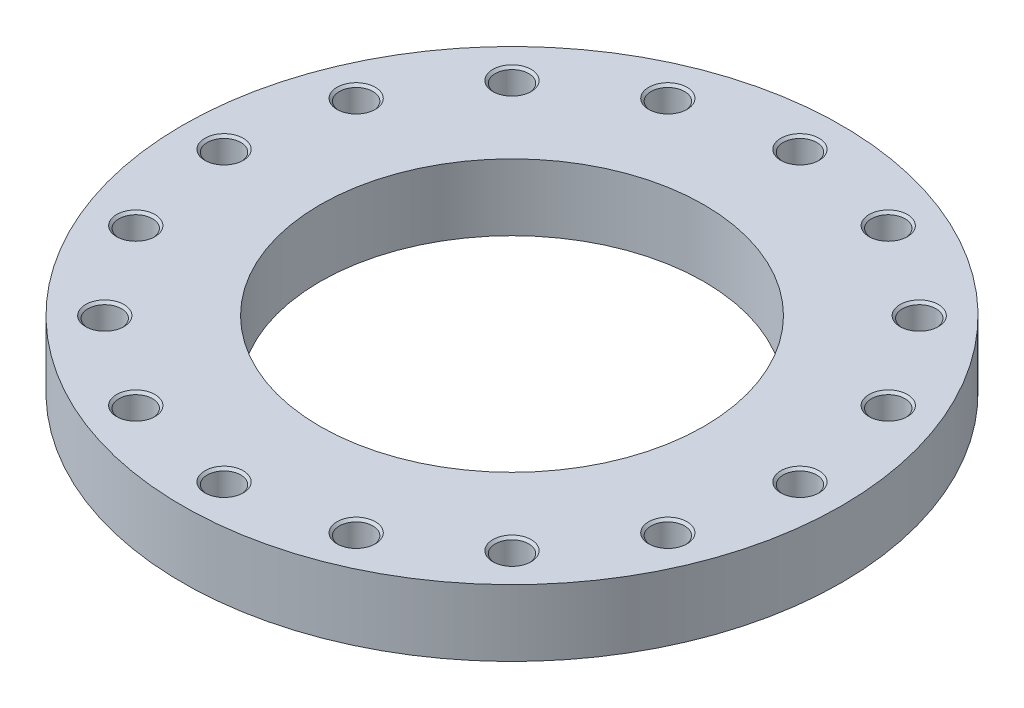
ISO-10303-21;
HEADER;
FILE_DESCRIPTION(('STEP AP214'),'2;1');
FILE_NAME('part.step','',(''),(''),'','','');
FILE_SCHEMA(('AUTOMOTIVE_DESIGN { 1 0 10303 214 1 1 1 1 }'));
ENDSEC;
DATA;
#1=APPLICATION_CONTEXT('core data for automotive mechanical design processes');
#2=APPLICATION_PROTOCOL_DEFINITION('international standard','automotive_design',2000,#1);
#3=PRODUCT_CONTEXT('',#1,'mechanical');
#4=PRODUCT('Part','Part','',(#3));
#5=PRODUCT_RELATED_PRODUCT_CATEGORY('part','',(#4));
#6=PRODUCT_DEFINITION_FORMATION('','',#4);
#7=PRODUCT_DEFINITION_CONTEXT('part definition',#1,'design');
#8=PRODUCT_DEFINITION('design','',#6,#7);
#9=PRODUCT_DEFINITION_SHAPE('','',#8);
#10=(LENGTH_UNIT() NAMED_UNIT(*) SI_UNIT(.MILLI.,.METRE.));
#11=(NAMED_UNIT(*) PLANE_ANGLE_UNIT() SI_UNIT($,.RADIAN.));
#12=(NAMED_UNIT(*) SI_UNIT($,.STERADIAN.) SOLID_ANGLE_UNIT());
#13=UNCERTAINTY_MEASURE_WITH_UNIT(LENGTH_MEASURE(1.E-05),#10,'distance_accuracy_value','');
#14=(GEOMETRIC_REPRESENTATION_CONTEXT(3) GLOBAL_UNCERTAINTY_ASSIGNED_CONTEXT((#13)) GLOBAL_UNIT_ASSIGNED_CONTEXT((#10,
#11,#12)) REPRESENTATION_CONTEXT('',''));
#15=CARTESIAN_POINT('',(0.,0.,0.));
#16=DIRECTION('',(0.,0.,1.));
#17=DIRECTION('',(1.,0.,0.));
#18=AXIS2_PLACEMENT_3D('',#15,#16,#17);
#19=CARTESIAN_POINT('',(0.,26.,0.));
#20=DIRECTION('',(0.,-1.,0.));
#21=DIRECTION('',(1.,0.,0.));
#22=AXIS2_PLACEMENT_3D('',#19,#20,#21);
#23=CYLINDRICAL_SURFACE('',#22,257.5);
#24=CARTESIAN_POINT('',(0.,0.,0.));
#25=DIRECTION('',(0.,1.,0.));
#26=DIRECTION('',(1.,0.,0.));
#27=AXIS2_PLACEMENT_3D('',#24,#25,#26);
#28=CIRCLE('',#27,257.5);
#29=CARTESIAN_POINT('',(257.5,0.,0.));
#30=VERTEX_POINT('',#29);
#31=EDGE_CURVE('E9',#30,#30,#28,.T.);
#32=ORIENTED_EDGE('',*,*,#31,.T.);
#33=EDGE_LOOP('',(#32));
#34=FACE_BOUND('',#33,.T.);
#35=CARTESIAN_POINT('',(0.,52.,0.));
#36=DIRECTION('',(0.,1.,0.));
#37=DIRECTION('',(1.,0.,0.));
#38=AXIS2_PLACEMENT_3D('',#35,#36,#37);
#39=CIRCLE('',#38,257.5);
#40=CARTESIAN_POINT('',(257.5,52.,0.));
#41=VERTEX_POINT('',#40);
#42=EDGE_CURVE('E68',#41,#41,#39,.T.);
#43=ORIENTED_EDGE('',*,*,#42,.F.);
#44=EDGE_LOOP('',(#43));
#45=FACE_BOUND('',#44,.T.);
#46=ADVANCED_FACE('F15',(#34,#45),#23,.T.);
#47=CARTESIAN_POINT('',(203.75,0.,0.));
#48=DIRECTION('',(0.,-1.,0.));
#49=DIRECTION('',(-1.,0.,0.));
#50=AXIS2_PLACEMENT_3D('',#47,#48,#49);
#51=PLANE('',#50);
#52=CARTESIAN_POINT('',(0.,0.,0.));
#53=DIRECTION('',(0.,1.,0.));
#54=DIRECTION('',(1.,0.,0.));
#55=AXIS2_PLACEMENT_3D('',#52,#53,#54);
#56=CIRCLE('',#55,150.);
#57=CARTESIAN_POINT('',(150.,0.,0.));
#58=VERTEX_POINT('',#57);
#59=EDGE_CURVE('E18',#58,#58,#56,.T.);
#60=ORIENTED_EDGE('',*,*,#59,.T.);
#61=EDGE_LOOP('',(#60));
#62=FACE_BOUND('',#61,.T.);
#63=ORIENTED_EDGE('',*,*,#31,.F.);
#64=EDGE_LOOP('',(#63));
#65=FACE_BOUND('',#64,.T.);
#66=ADVANCED_FACE('F491',(#62,#65),#51,.T.);
#67=CARTESIAN_POINT('',(0.,26.,0.));
#68=DIRECTION('',(0.,-1.,0.));
#69=DIRECTION('',(1.,0.,0.));
#70=AXIS2_PLACEMENT_3D('',#67,#68,#69);
#71=CYLINDRICAL_SURFACE('',#70,150.);
#72=CARTESIAN_POINT('',(0.,52.,0.));
#73=DIRECTION('',(0.,1.,0.));
#74=DIRECTION('',(1.,0.,0.));
#75=AXIS2_PLACEMENT_3D('',#72,#73,#74);
#76=CIRCLE('',#75,150.);
#77=CARTESIAN_POINT('',(150.,52.,0.));
#78=VERTEX_POINT('',#77);
#79=EDGE_CURVE('E73',#78,#78,#76,.T.);
#80=ORIENTED_EDGE('',*,*,#79,.T.);
#81=EDGE_LOOP('',(#80));
#82=FACE_BOUND('',#81,.T.);
#83=ORIENTED_EDGE('',*,*,#59,.F.);
#84=EDGE_LOOP('',(#83));
#85=FACE_BOUND('',#84,.T.);
#86=ADVANCED_FACE('F494',(#82,#85),#71,.F.);
#87=CARTESIAN_POINT('',(203.75,52.,0.));
#88=DIRECTION('',(0.,1.,0.));
#89=DIRECTION('',(1.,0.,0.));
#90=AXIS2_PLACEMENT_3D('',#87,#88,#89);
#91=PLANE('',#90);
#92=ORIENTED_EDGE('',*,*,#42,.T.);
#93=EDGE_LOOP('',(#92));
#94=FACE_BOUND('',#93,.T.);
#95=ORIENTED_EDGE('',*,*,#79,.F.);
#96=EDGE_LOOP('',(#95));
#97=FACE_BOUND('',#96,.T.);
#98=CARTESIAN_POINT('',(225.,52.,0.));
#99=DIRECTION('',(0.,-1.,0.));
#100=DIRECTION('',(1.,0.,0.));
#101=AXIS2_PLACEMENT_3D('',#98,#99,#100);
#102=CIRCLE('',#101,15.);
#103=CARTESIAN_POINT('',(240.,52.,0.));
#104=VERTEX_POINT('',#103);
#105=EDGE_CURVE('E482',#104,#104,#102,.T.);
#106=ORIENTED_EDGE('',*,*,#105,.T.);
#107=EDGE_LOOP('',(#106));
#108=FACE_BOUND('',#107,.T.);
#109=CARTESIAN_POINT('',(207.87289481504,52.,-86.1037722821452));
#110=DIRECTION('',(0.,-1.,0.));
#111=DIRECTION('',(0.923879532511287,0.,-0.38268343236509));
#112=AXIS2_PLACEMENT_3D('',#109,#110,#111);
#113=CIRCLE('',#112,15.);
#114=CARTESIAN_POINT('',(221.731087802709,52.,-91.8440237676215));
#115=VERTEX_POINT('',#114);
#116=EDGE_CURVE('E477',#115,#115,#113,.T.);
#117=ORIENTED_EDGE('',*,*,#116,.T.);
#118=EDGE_LOOP('',(#117));
#119=FACE_BOUND('',#118,.T.);
#120=CARTESIAN_POINT('',(159.099025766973,52.,-159.099025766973));
#121=DIRECTION('',(0.,-1.,0.));
#122=DIRECTION('',(0.707106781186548,0.,-0.707106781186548));
#123=AXIS2_PLACEMENT_3D('',#120,#121,#122);
#124=CIRCLE('',#123,15.);
#125=CARTESIAN_POINT('',(169.705627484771,52.,-169.705627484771));
#126=VERTEX_POINT('',#125);
#127=EDGE_CURVE('E412',#126,#126,#124,.T.);
#128=ORIENTED_EDGE('',*,*,#127,.T.);
#129=EDGE_LOOP('',(#128));
#130=FACE_BOUND('',#129,.T.);
#131=CARTESIAN_POINT('',(86.1037722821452,52.,-207.87289481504));
#132=DIRECTION('',(0.,-1.,0.));
#133=DIRECTION('',(0.38268343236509,0.,-0.923879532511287));
#134=AXIS2_PLACEMENT_3D('',#131,#132,#133);
#135=CIRCLE('',#134,15.);
#136=CARTESIAN_POINT('',(91.8440237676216,52.,-221.731087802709));
#137=VERTEX_POINT('',#136);
#138=EDGE_CURVE('E466',#137,#137,#135,.T.);
#139=ORIENTED_EDGE('',*,*,#138,.T.);
#140=EDGE_LOOP('',(#139));
#141=FACE_BOUND('',#140,.T.);
#142=CARTESIAN_POINT('',(0.,52.,-225.));
#143=DIRECTION('',(0.,-1.,0.));
#144=DIRECTION('',(0.,0.,-1.));
#145=AXIS2_PLACEMENT_3D('',#142,#143,#144);
#146=CIRCLE('',#145,15.);
#147=CARTESIAN_POINT('',(0.,52.,-240.));
#148=VERTEX_POINT('',#147);
#149=EDGE_CURVE('E419',#148,#148,#146,.T.);
#150=ORIENTED_EDGE('',*,*,#149,.T.);
#151=EDGE_LOOP('',(#150));
#152=FACE_BOUND('',#151,.T.);
#153=CARTESIAN_POINT('',(-86.1037722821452,52.,-207.87289481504));
#154=DIRECTION('',(0.,-1.,0.));
#155=DIRECTION('',(-0.38268343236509,0.,-0.923879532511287));
#156=AXIS2_PLACEMENT_3D('',#153,#154,#155);
#157=CIRCLE('',#156,15.);
#158=CARTESIAN_POINT('',(-91.8440237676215,52.,-221.731087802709));
#159=VERTEX_POINT('',#158);
#160=EDGE_CURVE('E405',#159,#159,#157,.T.);
#161=ORIENTED_EDGE('',*,*,#160,.T.);
#162=EDGE_LOOP('',(#161));
#163=FACE_BOUND('',#162,.T.);
#164=CARTESIAN_POINT('',(-159.099025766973,52.,-159.099025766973));
#165=DIRECTION('',(0.,-1.,0.));
#166=DIRECTION('',(-0.707106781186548,0.,-0.707106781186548));
#167=AXIS2_PLACEMENT_3D('',#164,#165,#166);
#168=CIRCLE('',#167,15.);
#169=CARTESIAN_POINT('',(-169.705627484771,52.,-169.705627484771));
#170=VERTEX_POINT('',#169);
#171=EDGE_CURVE('E441',#170,#170,#168,.T.);
#172=ORIENTED_EDGE('',*,*,#171,.T.);
#173=EDGE_LOOP('',(#172));
#174=FACE_BOUND('',#173,.T.);
#175=CARTESIAN_POINT('',(-207.87289481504,52.,-86.1037722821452));
#176=DIRECTION('',(0.,-1.,0.));
#177=DIRECTION('',(-0.923879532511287,0.,-0.38268343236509));
#178=AXIS2_PLACEMENT_3D('',#175,#176,#177);
#179=CIRCLE('',#178,15.);
#180=CARTESIAN_POINT('',(-221.731087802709,52.,-91.8440237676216));
#181=VERTEX_POINT('',#180);
#182=EDGE_CURVE('E426',#181,#181,#179,.T.);
#183=ORIENTED_EDGE('',*,*,#182,.T.);
#184=EDGE_LOOP('',(#183));
#185=FACE_BOUND('',#184,.T.);
#186=CARTESIAN_POINT('',(-225.,52.,0.));
#187=DIRECTION('',(0.,-1.,0.));
#188=DIRECTION('',(-1.,0.,0.));
#189=AXIS2_PLACEMENT_3D('',#186,#187,#188);
#190=CIRCLE('',#189,15.);
#191=CARTESIAN_POINT('',(-240.,52.,0.));
#192=VERTEX_POINT('',#191);
#193=EDGE_CURVE('E404',#192,#192,#190,.T.);
#194=ORIENTED_EDGE('',*,*,#193,.T.);
#195=EDGE_LOOP('',(#194));
#196=FACE_BOUND('',#195,.T.);
#197=CARTESIAN_POINT('',(-207.87289481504,52.,86.1037722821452));
#198=DIRECTION('',(0.,-1.,0.));
#199=DIRECTION('',(-0.923879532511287,0.,0.38268343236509));
#200=AXIS2_PLACEMENT_3D('',#197,#198,#199);
#201=CIRCLE('',#200,15.);
#202=CARTESIAN_POINT('',(-221.731087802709,52.,91.8440237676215));
#203=VERTEX_POINT('',#202);
#204=EDGE_CURVE('E393',#203,#203,#201,.T.);
#205=ORIENTED_EDGE('',*,*,#204,.T.);
#206=EDGE_LOOP('',(#205));
#207=FACE_BOUND('',#206,.T.);
#208=CARTESIAN_POINT('',(-159.099025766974,52.,159.099025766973));
#209=DIRECTION('',(0.,-1.,0.));
#210=DIRECTION('',(-0.707106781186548,0.,0.707106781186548));
#211=AXIS2_PLACEMENT_3D('',#208,#209,#210);
#212=CIRCLE('',#211,15.);
#213=CARTESIAN_POINT('',(-169.705627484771,52.,169.705627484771));
#214=VERTEX_POINT('',#213);
#215=EDGE_CURVE('E376',#214,#214,#212,.T.);
#216=ORIENTED_EDGE('',*,*,#215,.T.);
#217=EDGE_LOOP('',(#216));
#218=FACE_BOUND('',#217,.T.);
#219=CARTESIAN_POINT('',(-86.1037722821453,52.,207.87289481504));
#220=DIRECTION('',(0.,-1.,0.));
#221=DIRECTION('',(-0.382683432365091,0.,0.923879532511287));
#222=AXIS2_PLACEMENT_3D('',#219,#220,#221);
#223=CIRCLE('',#222,15.);
#224=CARTESIAN_POINT('',(-91.8440237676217,52.,221.731087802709));
#225=VERTEX_POINT('',#224);
#226=EDGE_CURVE('E356',#225,#225,#223,.T.);
#227=ORIENTED_EDGE('',*,*,#226,.T.);
#228=EDGE_LOOP('',(#227));
#229=FACE_BOUND('',#228,.T.);
#230=CARTESIAN_POINT('',(0.,52.,225.));
#231=DIRECTION('',(0.,-1.,0.));
#232=DIRECTION('',(0.,0.,1.));
#233=AXIS2_PLACEMENT_3D('',#230,#231,#232);
#234=CIRCLE('',#233,15.);
#235=CARTESIAN_POINT('',(0.,52.,240.));
#236=VERTEX_POINT('',#235);
#237=EDGE_CURVE('E1554',#236,#236,#234,.T.);
#238=ORIENTED_EDGE('',*,*,#237,.T.);
#239=EDGE_LOOP('',(#238));
#240=FACE_BOUND('',#239,.T.);
#241=CARTESIAN_POINT('',(86.1037722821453,52.,207.87289481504));
#242=DIRECTION('',(0.,-1.,0.));
#243=DIRECTION('',(0.38268343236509,0.,0.923879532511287));
#244=AXIS2_PLACEMENT_3D('',#241,#242,#243);
#245=CIRCLE('',#244,15.);
#246=CARTESIAN_POINT('',(91.8440237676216,52.,221.731087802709));
#247=VERTEX_POINT('',#246);
#248=EDGE_CURVE('E1509',#247,#247,#245,.T.);
#249=ORIENTED_EDGE('',*,*,#248,.T.);
#250=EDGE_LOOP('',(#249));
#251=FACE_BOUND('',#250,.T.);
#252=CARTESIAN_POINT('',(159.099025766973,52.,159.099025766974));
#253=DIRECTION('',(0.,-1.,0.));
#254=DIRECTION('',(0.707106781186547,0.,0.707106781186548));
#255=AXIS2_PLACEMENT_3D('',#252,#253,#254);
#256=CIRCLE('',#255,15.);
#257=CARTESIAN_POINT('',(169.705627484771,52.,169.705627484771));
#258=VERTEX_POINT('',#257);
#259=EDGE_CURVE('E1522',#258,#258,#256,.T.);
#260=ORIENTED_EDGE('',*,*,#259,.T.);
#261=EDGE_LOOP('',(#260));
#262=FACE_BOUND('',#261,.T.);
#263=CARTESIAN_POINT('',(207.87289481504,52.,86.1037722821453));
#264=DIRECTION('',(0.,-1.,0.));
#265=DIRECTION('',(0.923879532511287,0.,0.382683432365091));
#266=AXIS2_PLACEMENT_3D('',#263,#264,#265);
#267=CIRCLE('',#266,15.);
#268=CARTESIAN_POINT('',(221.731087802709,52.,91.8440237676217));
#269=VERTEX_POINT('',#268);
#270=EDGE_CURVE('E1495',#269,#269,#267,.T.);
#271=ORIENTED_EDGE('',*,*,#270,.T.);
#272=EDGE_LOOP('',(#271));
#273=FACE_BOUND('',#272,.T.);
#274=ADVANCED_FACE('F496',(#94,#97,#108,#119,#130,#141,#152,#163,#174,#185,#196,#207,#218,#229,
#240,#251,#262,#273),#91,.T.);
#275=CARTESIAN_POINT('',(225.,8.21673193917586,0.));
#276=DIRECTION('',(0.,1.,0.));
#277=DIRECTION('',(1.,0.,0.));
#278=AXIS2_PLACEMENT_3D('',#275,#276,#277);
#279=CONICAL_SURFACE('',#278,6.5528125,1.0471975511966);
#280=CARTESIAN_POINT('',(225.,12.,0.));
#281=DIRECTION('',(0.,-1.,0.));
#282=DIRECTION('',(1.,0.,0.));
#283=AXIS2_PLACEMENT_3D('',#280,#281,#282);
#284=CIRCLE('',#283,13.105625);
#285=CARTESIAN_POINT('',(238.105625,12.,0.));
#286=VERTEX_POINT('',#285);
#287=EDGE_CURVE('E488',#286,#286,#284,.T.);
#288=ORIENTED_EDGE('',*,*,#287,.F.);
#289=EDGE_LOOP('',(#288));
#290=FACE_BOUND('',#289,.T.);
#291=CARTESIAN_POINT('',(225.,4.43346387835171,0.));
#292=VERTEX_POINT('',#291);
#293=VERTEX_LOOP('',#292);
#294=FACE_BOUND('',#293,.T.);
#295=ADVANCED_FACE('F503',(#290,#294),#279,.F.);
#296=CARTESIAN_POINT('',(225.,16.0528125,0.));
#297=DIRECTION('',(0.,1.,0.));
#298=DIRECTION('',(1.,0.,0.));
#299=AXIS2_PLACEMENT_3D('',#296,#297,#298);
#300=CYLINDRICAL_SURFACE('',#299,13.105625);
#301=CARTESIAN_POINT('',(225.,20.105625,0.));
#302=DIRECTION('',(0.,-1.,0.));
#303=DIRECTION('',(1.,0.,0.));
#304=AXIS2_PLACEMENT_3D('',#301,#302,#303);
#305=CIRCLE('',#304,13.105625);
#306=CARTESIAN_POINT('',(238.105625,20.105625,0.));
#307=VERTEX_POINT('',#306);
#308=EDGE_CURVE('E487',#307,#307,#305,.T.);
#309=ORIENTED_EDGE('',*,*,#308,.F.);
#310=EDGE_LOOP('',(#309));
#311=FACE_BOUND('',#310,.T.);
#312=ORIENTED_EDGE('',*,*,#287,.T.);
#313=EDGE_LOOP('',(#312));
#314=FACE_BOUND('',#313,.T.);
#315=ADVANCED_FACE('F540',(#311,#314),#300,.F.);
#316=CARTESIAN_POINT('',(225.,21.0528125,0.));
#317=DIRECTION('',(0.,1.,0.));
#318=DIRECTION('',(1.,0.,0.));
#319=AXIS2_PLACEMENT_3D('',#316,#317,#318);
#320=CONICAL_SURFACE('',#319,14.0528125,0.785398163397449);
#321=CARTESIAN_POINT('',(225.,22.,0.));
#322=DIRECTION('',(0.,-1.,0.));
#323=DIRECTION('',(1.,0.,0.));
#324=AXIS2_PLACEMENT_3D('',#321,#322,#323);
#325=CIRCLE('',#324,15.);
#326=CARTESIAN_POINT('',(240.,22.,0.));
#327=VERTEX_POINT('',#326);
#328=EDGE_CURVE('E485',#327,#327,#325,.T.);
#329=ORIENTED_EDGE('',*,*,#328,.F.);
#330=EDGE_LOOP('',(#329));
#331=FACE_BOUND('',#330,.T.);
#332=ORIENTED_EDGE('',*,*,#308,.T.);
#333=EDGE_LOOP('',(#332));
#334=FACE_BOUND('',#333,.T.);
#335=ADVANCED_FACE('F550',(#331,#334),#320,.F.);
#336=CARTESIAN_POINT('',(239.0528125,22.,0.));
#337=DIRECTION('',(0.,1.,0.));
#338=DIRECTION('',(-1.,0.,0.));
#339=AXIS2_PLACEMENT_3D('',#336,#337,#338);
#340=PLANE('',#339);
#341=CARTESIAN_POINT('',(225.,22.,0.));
#342=DIRECTION('',(0.,-1.,0.));
#343=DIRECTION('',(1.,0.,0.));
#344=AXIS2_PLACEMENT_3D('',#341,#342,#343);
#345=CIRCLE('',#344,13.105625);
#346=CARTESIAN_POINT('',(238.105625,22.,0.));
#347=VERTEX_POINT('',#346);
#348=EDGE_CURVE('E484',#347,#347,#345,.T.);
#349=ORIENTED_EDGE('',*,*,#348,.F.);
#350=EDGE_LOOP('',(#349));
#351=FACE_BOUND('',#350,.T.);
#352=ORIENTED_EDGE('',*,*,#328,.T.);
#353=EDGE_LOOP('',(#352));
#354=FACE_BOUND('',#353,.T.);
#355=ADVANCED_FACE('F560',(#351,#354),#340,.F.);
#356=CARTESIAN_POINT('',(225.,36.0528125,0.));
#357=DIRECTION('',(0.,1.,0.));
#358=DIRECTION('',(1.,0.,0.));
#359=AXIS2_PLACEMENT_3D('',#356,#357,#358);
#360=CYLINDRICAL_SURFACE('',#359,13.105625);
#361=CARTESIAN_POINT('',(225.,50.105625,0.));
#362=DIRECTION('',(0.,-1.,0.));
#363=DIRECTION('',(1.,0.,0.));
#364=AXIS2_PLACEMENT_3D('',#361,#362,#363);
#365=CIRCLE('',#364,13.105625);
#366=CARTESIAN_POINT('',(238.105625,50.105625,0.));
#367=VERTEX_POINT('',#366);
#368=EDGE_CURVE('E381',#367,#367,#365,.T.);
#369=ORIENTED_EDGE('',*,*,#368,.F.);
#370=EDGE_LOOP('',(#369));
#371=FACE_BOUND('',#370,.T.);
#372=ORIENTED_EDGE('',*,*,#348,.T.);
#373=EDGE_LOOP('',(#372));
#374=FACE_BOUND('',#373,.T.);
#375=ADVANCED_FACE('F570',(#371,#374),#360,.F.);
#376=CARTESIAN_POINT('',(225.,51.0528125,0.));
#377=DIRECTION('',(0.,1.,0.));
#378=DIRECTION('',(1.,0.,0.));
#379=AXIS2_PLACEMENT_3D('',#376,#377,#378);
#380=CONICAL_SURFACE('',#379,14.0528125,0.785398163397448);
#381=ORIENTED_EDGE('',*,*,#105,.F.);
#382=EDGE_LOOP('',(#381));
#383=FACE_BOUND('',#382,.T.);
#384=ORIENTED_EDGE('',*,*,#368,.T.);
#385=EDGE_LOOP('',(#384));
#386=FACE_BOUND('',#385,.T.);
#387=ADVANCED_FACE('F580',(#383,#386),#380,.F.);
#388=CARTESIAN_POINT('',(207.87289481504,8.21673193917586,-86.1037722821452));
#389=DIRECTION('',(0.,1.,0.));
#390=DIRECTION('',(0.923879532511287,0.,-0.38268343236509));
#391=AXIS2_PLACEMENT_3D('',#388,#389,#390);
#392=CONICAL_SURFACE('',#391,6.5528125,1.0471975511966);
#393=CARTESIAN_POINT('',(207.87289481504,12.,-86.1037722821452));
#394=DIRECTION('',(0.,-1.,0.));
#395=DIRECTION('',(0.923879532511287,0.,-0.38268343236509));
#396=AXIS2_PLACEMENT_3D('',#393,#394,#395);
#397=CIRCLE('',#396,13.105625);
#398=CARTESIAN_POINT('',(219.980913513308,12.,-91.1190778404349));
#399=VERTEX_POINT('',#398);
#400=EDGE_CURVE('E379',#399,#399,#397,.T.);
#401=ORIENTED_EDGE('',*,*,#400,.F.);
#402=EDGE_LOOP('',(#401));
#403=FACE_BOUND('',#402,.T.);
#404=CARTESIAN_POINT('',(207.87289481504,4.43346387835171,-86.1037722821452));
#405=VERTEX_POINT('',#404);
#406=VERTEX_LOOP('',#405);
#407=FACE_BOUND('',#406,.T.);
#408=ADVANCED_FACE('F590',(#403,#407),#392,.F.);
#409=CARTESIAN_POINT('',(207.87289481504,16.0528125,-86.1037722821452));
#410=DIRECTION('',(0.,1.,0.));
#411=DIRECTION('',(0.923879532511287,0.,-0.38268343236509));
#412=AXIS2_PLACEMENT_3D('',#409,#410,#411);
#413=CYLINDRICAL_SURFACE('',#412,13.105625);
#414=CARTESIAN_POINT('',(207.87289481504,20.105625,-86.1037722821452));
#415=DIRECTION('',(0.,-1.,0.));
#416=DIRECTION('',(0.923879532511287,0.,-0.38268343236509));
#417=AXIS2_PLACEMENT_3D('',#414,#415,#416);
#418=CIRCLE('',#417,13.105625);
#419=CARTESIAN_POINT('',(219.980913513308,20.105625,-91.1190778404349));
#420=VERTEX_POINT('',#419);
#421=EDGE_CURVE('E382',#420,#420,#418,.T.);
#422=ORIENTED_EDGE('',*,*,#421,.F.);
#423=EDGE_LOOP('',(#422));
#424=FACE_BOUND('',#423,.T.);
#425=ORIENTED_EDGE('',*,*,#400,.T.);
#426=EDGE_LOOP('',(#425));
#427=FACE_BOUND('',#426,.T.);
#428=ADVANCED_FACE('F599',(#424,#427),#413,.F.);
#429=CARTESIAN_POINT('',(207.87289481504,21.0528125,-86.1037722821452));
#430=DIRECTION('',(0.,1.,0.));
#431=DIRECTION('',(0.923879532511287,0.,-0.38268343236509));
#432=AXIS2_PLACEMENT_3D('',#429,#430,#431);
#433=CONICAL_SURFACE('',#432,14.0528125,0.785398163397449);
#434=CARTESIAN_POINT('',(207.87289481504,22.,-86.1037722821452));
#435=DIRECTION('',(0.,-1.,0.));
#436=DIRECTION('',(0.923879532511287,0.,-0.38268343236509));
#437=AXIS2_PLACEMENT_3D('',#434,#435,#436);
#438=CIRCLE('',#437,15.);
#439=CARTESIAN_POINT('',(221.731087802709,22.,-91.8440237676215));
#440=VERTEX_POINT('',#439);
#441=EDGE_CURVE('E386',#440,#440,#438,.T.);
#442=ORIENTED_EDGE('',*,*,#441,.F.);
#443=EDGE_LOOP('',(#442));
#444=FACE_BOUND('',#443,.T.);
#445=ORIENTED_EDGE('',*,*,#421,.T.);
#446=EDGE_LOOP('',(#445));
#447=FACE_BOUND('',#446,.T.);
#448=ADVANCED_FACE('F609',(#444,#447),#433,.F.);
#449=CARTESIAN_POINT('',(220.856000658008,22.,-91.4815508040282));
#450=DIRECTION('',(0.,1.,0.));
#451=DIRECTION('',(-0.923879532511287,0.,0.38268343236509));
#452=AXIS2_PLACEMENT_3D('',#449,#450,#451);
#453=PLANE('',#452);
#454=CARTESIAN_POINT('',(207.87289481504,22.,-86.1037722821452));
#455=DIRECTION('',(0.,-1.,0.));
#456=DIRECTION('',(0.923879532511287,0.,-0.38268343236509));
#457=AXIS2_PLACEMENT_3D('',#454,#455,#456);
#458=CIRCLE('',#457,13.105625);
#459=CARTESIAN_POINT('',(219.980913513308,22.,-91.1190778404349));
#460=VERTEX_POINT('',#459);
#461=EDGE_CURVE('E388',#460,#460,#458,.T.);
#462=ORIENTED_EDGE('',*,*,#461,.F.);
#463=EDGE_LOOP('',(#462));
#464=FACE_BOUND('',#463,.T.);
#465=ORIENTED_EDGE('',*,*,#441,.T.);
#466=EDGE_LOOP('',(#465));
#467=FACE_BOUND('',#466,.T.);
#468=ADVANCED_FACE('F619',(#464,#467),#453,.F.);
#469=CARTESIAN_POINT('',(207.87289481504,36.0528125,-86.1037722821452));
#470=DIRECTION('',(0.,1.,0.));
#471=DIRECTION('',(0.923879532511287,0.,-0.38268343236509));
#472=AXIS2_PLACEMENT_3D('',#469,#470,#471);
#473=CYLINDRICAL_SURFACE('',#472,13.105625);
#474=CARTESIAN_POINT('',(207.87289481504,50.105625,-86.1037722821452));
#475=DIRECTION('',(0.,-1.,0.));
#476=DIRECTION('',(0.923879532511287,0.,-0.38268343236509));
#477=AXIS2_PLACEMENT_3D('',#474,#475,#476);
#478=CIRCLE('',#477,13.105625);
#479=CARTESIAN_POINT('',(219.980913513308,50.105625,-91.1190778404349));
#480=VERTEX_POINT('',#479);
#481=EDGE_CURVE('E475',#480,#480,#478,.T.);
#482=ORIENTED_EDGE('',*,*,#481,.F.);
#483=EDGE_LOOP('',(#482));
#484=FACE_BOUND('',#483,.T.);
#485=ORIENTED_EDGE('',*,*,#461,.T.);
#486=EDGE_LOOP('',(#485));
#487=FACE_BOUND('',#486,.T.);
#488=ADVANCED_FACE('F629',(#484,#487),#473,.F.);
#489=CARTESIAN_POINT('',(207.87289481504,51.0528125,-86.1037722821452));
#490=DIRECTION('',(0.,1.,0.));
#491=DIRECTION('',(0.923879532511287,0.,-0.38268343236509));
#492=AXIS2_PLACEMENT_3D('',#489,#490,#491);
#493=CONICAL_SURFACE('',#492,14.0528125,0.785398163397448);
#494=ORIENTED_EDGE('',*,*,#116,.F.);
#495=EDGE_LOOP('',(#494));
#496=FACE_BOUND('',#495,.T.);
#497=ORIENTED_EDGE('',*,*,#481,.T.);
#498=EDGE_LOOP('',(#497));
#499=FACE_BOUND('',#498,.T.);
#500=ADVANCED_FACE('F639',(#496,#499),#493,.F.);
#501=CARTESIAN_POINT('',(159.099025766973,8.21673193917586,-159.099025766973));
#502=DIRECTION('',(0.,1.,0.));
#503=DIRECTION('',(0.707106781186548,0.,-0.707106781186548));
#504=AXIS2_PLACEMENT_3D('',#501,#502,#503);
#505=CONICAL_SURFACE('',#504,6.5528125,1.0471975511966);
#506=CARTESIAN_POINT('',(159.099025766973,12.,-159.099025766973));
#507=DIRECTION('',(0.,-1.,0.));
#508=DIRECTION('',(0.707106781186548,0.,-0.707106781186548));
#509=AXIS2_PLACEMENT_3D('',#506,#507,#508);
#510=CIRCLE('',#509,13.105625);
#511=CARTESIAN_POINT('',(168.366102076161,12.,-168.366102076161));
#512=VERTEX_POINT('',#511);
#513=EDGE_CURVE('E474',#512,#512,#510,.T.);
#514=ORIENTED_EDGE('',*,*,#513,.F.);
#515=EDGE_LOOP('',(#514));
#516=FACE_BOUND('',#515,.T.);
#517=CARTESIAN_POINT('',(159.099025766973,4.43346387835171,-159.099025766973));
#518=VERTEX_POINT('',#517);
#519=VERTEX_LOOP('',#518);
#520=FACE_BOUND('',#519,.T.);
#521=ADVANCED_FACE('F649',(#516,#520),#505,.F.);
#522=CARTESIAN_POINT('',(159.099025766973,16.0528125,-159.099025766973));
#523=DIRECTION('',(0.,1.,0.));
#524=DIRECTION('',(0.707106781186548,0.,-0.707106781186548));
#525=AXIS2_PLACEMENT_3D('',#522,#523,#524);
#526=CYLINDRICAL_SURFACE('',#525,13.105625);
#527=CARTESIAN_POINT('',(159.099025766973,20.105625,-159.099025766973));
#528=DIRECTION('',(0.,-1.,0.));
#529=DIRECTION('',(0.707106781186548,0.,-0.707106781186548));
#530=AXIS2_PLACEMENT_3D('',#527,#528,#529);
#531=CIRCLE('',#530,13.105625);
#532=CARTESIAN_POINT('',(168.366102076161,20.105625,-168.366102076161));
#533=VERTEX_POINT('',#532);
#534=EDGE_CURVE('E472',#533,#533,#531,.T.);
#535=ORIENTED_EDGE('',*,*,#534,.F.);
#536=EDGE_LOOP('',(#535));
#537=FACE_BOUND('',#536,.T.);
#538=ORIENTED_EDGE('',*,*,#513,.T.);
#539=EDGE_LOOP('',(#538));
#540=FACE_BOUND('',#539,.T.);
#541=ADVANCED_FACE('F659',(#537,#540),#526,.F.);
#542=CARTESIAN_POINT('',(159.099025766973,21.0528125,-159.099025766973));
#543=DIRECTION('',(0.,1.,0.));
#544=DIRECTION('',(0.707106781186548,0.,-0.707106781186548));
#545=AXIS2_PLACEMENT_3D('',#542,#543,#544);
#546=CONICAL_SURFACE('',#545,14.0528125,0.785398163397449);
#547=CARTESIAN_POINT('',(159.099025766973,22.,-159.099025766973));
#548=DIRECTION('',(0.,-1.,0.));
#549=DIRECTION('',(0.707106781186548,0.,-0.707106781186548));
#550=AXIS2_PLACEMENT_3D('',#547,#548,#549);
#551=CIRCLE('',#550,15.);
#552=CARTESIAN_POINT('',(169.705627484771,22.,-169.705627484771));
#553=VERTEX_POINT('',#552);
#554=EDGE_CURVE('E471',#553,#553,#551,.T.);
#555=ORIENTED_EDGE('',*,*,#554,.F.);
#556=EDGE_LOOP('',(#555));
#557=FACE_BOUND('',#556,.T.);
#558=ORIENTED_EDGE('',*,*,#534,.T.);
#559=EDGE_LOOP('',(#558));
#560=FACE_BOUND('',#559,.T.);
#561=ADVANCED_FACE('F669',(#557,#560),#546,.F.);
#562=CARTESIAN_POINT('',(169.035864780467,22.,-169.035864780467));
#563=DIRECTION('',(0.,1.,0.));
#564=DIRECTION('',(-0.707106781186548,0.,0.707106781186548));
#565=AXIS2_PLACEMENT_3D('',#562,#563,#564);
#566=PLANE('',#565);
#567=CARTESIAN_POINT('',(159.099025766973,22.,-159.099025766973));
#568=DIRECTION('',(0.,-1.,0.));
#569=DIRECTION('',(0.707106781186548,0.,-0.707106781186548));
#570=AXIS2_PLACEMENT_3D('',#567,#568,#569);
#571=CIRCLE('',#570,13.105625);
#572=CARTESIAN_POINT('',(168.366102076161,22.,-168.366102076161));
#573=VERTEX_POINT('',#572);
#574=EDGE_CURVE('E414',#573,#573,#571,.T.);
#575=ORIENTED_EDGE('',*,*,#574,.F.);
#576=EDGE_LOOP('',(#575));
#577=FACE_BOUND('',#576,.T.);
#578=ORIENTED_EDGE('',*,*,#554,.T.);
#579=EDGE_LOOP('',(#578));
#580=FACE_BOUND('',#579,.T.);
#581=ADVANCED_FACE('F679',(#577,#580),#566,.F.);
#582=CARTESIAN_POINT('',(159.099025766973,36.0528125,-159.099025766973));
#583=DIRECTION('',(0.,1.,0.));
#584=DIRECTION('',(0.707106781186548,0.,-0.707106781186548));
#585=AXIS2_PLACEMENT_3D('',#582,#583,#584);
#586=CYLINDRICAL_SURFACE('',#585,13.105625);
#587=CARTESIAN_POINT('',(159.099025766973,50.105625,-159.099025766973));
#588=DIRECTION('',(0.,-1.,0.));
#589=DIRECTION('',(0.707106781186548,0.,-0.707106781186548));
#590=AXIS2_PLACEMENT_3D('',#587,#588,#589);
#591=CIRCLE('',#590,13.105625);
#592=CARTESIAN_POINT('',(168.366102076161,50.105625,-168.366102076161));
#593=VERTEX_POINT('',#592);
#594=EDGE_CURVE('E251',#593,#593,#591,.T.);
#595=ORIENTED_EDGE('',*,*,#594,.F.);
#596=EDGE_LOOP('',(#595));
#597=FACE_BOUND('',#596,.T.);
#598=ORIENTED_EDGE('',*,*,#574,.T.);
#599=EDGE_LOOP('',(#598));
#600=FACE_BOUND('',#599,.T.);
#601=ADVANCED_FACE('F689',(#597,#600),#586,.F.);
#602=CARTESIAN_POINT('',(159.099025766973,51.0528125,-159.099025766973));
#603=DIRECTION('',(0.,1.,0.));
#604=DIRECTION('',(0.707106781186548,0.,-0.707106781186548));
#605=AXIS2_PLACEMENT_3D('',#602,#603,#604);
#606=CONICAL_SURFACE('',#605,14.0528125,0.785398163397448);
#607=ORIENTED_EDGE('',*,*,#127,.F.);
#608=EDGE_LOOP('',(#607));
#609=FACE_BOUND('',#608,.T.);
#610=ORIENTED_EDGE('',*,*,#594,.T.);
#611=EDGE_LOOP('',(#610));
#612=FACE_BOUND('',#611,.T.);
#613=ADVANCED_FACE('F699',(#609,#612),#606,.F.);
#614=CARTESIAN_POINT('',(86.1037722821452,8.21673193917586,-207.87289481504));
#615=DIRECTION('',(0.,1.,0.));
#616=DIRECTION('',(0.38268343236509,0.,-0.923879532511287));
#617=AXIS2_PLACEMENT_3D('',#614,#615,#616);
#618=CONICAL_SURFACE('',#617,6.5528125,1.0471975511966);
#619=CARTESIAN_POINT('',(86.1037722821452,12.,-207.87289481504));
#620=DIRECTION('',(0.,-1.,0.));
#621=DIRECTION('',(0.38268343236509,0.,-0.923879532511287));
#622=AXIS2_PLACEMENT_3D('',#619,#620,#621);
#623=CIRCLE('',#622,13.105625);
#624=CARTESIAN_POINT('',(91.1190778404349,12.,-219.980913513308));
#625=VERTEX_POINT('',#624);
#626=EDGE_CURVE('E256',#625,#625,#623,.T.);
#627=ORIENTED_EDGE('',*,*,#626,.F.);
#628=EDGE_LOOP('',(#627));
#629=FACE_BOUND('',#628,.T.);
#630=CARTESIAN_POINT('',(86.1037722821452,4.43346387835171,-207.87289481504));
#631=VERTEX_POINT('',#630);
#632=VERTEX_LOOP('',#631);
#633=FACE_BOUND('',#632,.T.);
#634=ADVANCED_FACE('F709',(#629,#633),#618,.F.);
#635=CARTESIAN_POINT('',(86.1037722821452,16.0528125,-207.87289481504));
#636=DIRECTION('',(0.,1.,0.));
#637=DIRECTION('',(0.38268343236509,0.,-0.923879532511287));
#638=AXIS2_PLACEMENT_3D('',#635,#636,#637);
#639=CYLINDRICAL_SURFACE('',#638,13.105625);
#640=CARTESIAN_POINT('',(86.1037722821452,20.105625,-207.87289481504));
#641=DIRECTION('',(0.,-1.,0.));
#642=DIRECTION('',(0.38268343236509,0.,-0.923879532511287));
#643=AXIS2_PLACEMENT_3D('',#640,#641,#642);
#644=CIRCLE('',#643,13.105625);
#645=CARTESIAN_POINT('',(91.1190778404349,20.105625,-219.980913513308));
#646=VERTEX_POINT('',#645);
#647=EDGE_CURVE('E467',#646,#646,#644,.T.);
#648=ORIENTED_EDGE('',*,*,#647,.F.);
#649=EDGE_LOOP('',(#648));
#650=FACE_BOUND('',#649,.T.);
#651=ORIENTED_EDGE('',*,*,#626,.T.);
#652=EDGE_LOOP('',(#651));
#653=FACE_BOUND('',#652,.T.);
#654=ADVANCED_FACE('F719',(#650,#653),#639,.F.);
#655=CARTESIAN_POINT('',(86.1037722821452,21.0528125,-207.87289481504));
#656=DIRECTION('',(0.,1.,0.));
#657=DIRECTION('',(0.38268343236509,0.,-0.923879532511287));
#658=AXIS2_PLACEMENT_3D('',#655,#656,#657);
#659=CONICAL_SURFACE('',#658,14.0528125,0.785398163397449);
#660=CARTESIAN_POINT('',(86.1037722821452,22.,-207.87289481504));
#661=DIRECTION('',(0.,-1.,0.));
#662=DIRECTION('',(0.38268343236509,0.,-0.923879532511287));
#663=AXIS2_PLACEMENT_3D('',#660,#661,#662);
#664=CIRCLE('',#663,15.);
#665=CARTESIAN_POINT('',(91.8440237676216,22.,-221.731087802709));
#666=VERTEX_POINT('',#665);
#667=EDGE_CURVE('E465',#666,#666,#664,.T.);
#668=ORIENTED_EDGE('',*,*,#667,.F.);
#669=EDGE_LOOP('',(#668));
#670=FACE_BOUND('',#669,.T.);
#671=ORIENTED_EDGE('',*,*,#647,.T.);
#672=EDGE_LOOP('',(#671));
#673=FACE_BOUND('',#672,.T.);
#674=ADVANCED_FACE('F729',(#670,#673),#659,.F.);
#675=CARTESIAN_POINT('',(91.4815508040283,22.,-220.856000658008));
#676=DIRECTION('',(0.,1.,0.));
#677=DIRECTION('',(-0.38268343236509,0.,0.923879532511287));
#678=AXIS2_PLACEMENT_3D('',#675,#676,#677);
#679=PLANE('',#678);
#680=CARTESIAN_POINT('',(86.1037722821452,22.,-207.87289481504));
#681=DIRECTION('',(0.,-1.,0.));
#682=DIRECTION('',(0.38268343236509,0.,-0.923879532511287));
#683=AXIS2_PLACEMENT_3D('',#680,#681,#682);
#684=CIRCLE('',#683,13.105625);
#685=CARTESIAN_POINT('',(91.1190778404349,22.,-219.980913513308));
#686=VERTEX_POINT('',#685);
#687=EDGE_CURVE('E463',#686,#686,#684,.T.);
#688=ORIENTED_EDGE('',*,*,#687,.F.);
#689=EDGE_LOOP('',(#688));
#690=FACE_BOUND('',#689,.T.);
#691=ORIENTED_EDGE('',*,*,#667,.T.);
#692=EDGE_LOOP('',(#691));
#693=FACE_BOUND('',#692,.T.);
#694=ADVANCED_FACE('F739',(#690,#693),#679,.F.);
#695=CARTESIAN_POINT('',(86.1037722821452,36.0528125,-207.87289481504));
#696=DIRECTION('',(0.,1.,0.));
#697=DIRECTION('',(0.38268343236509,0.,-0.923879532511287));
#698=AXIS2_PLACEMENT_3D('',#695,#696,#697);
#699=CYLINDRICAL_SURFACE('',#698,13.105625);
#700=CARTESIAN_POINT('',(86.1037722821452,50.105625,-207.87289481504));
#701=DIRECTION('',(0.,-1.,0.));
#702=DIRECTION('',(0.38268343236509,0.,-0.923879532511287));
#703=AXIS2_PLACEMENT_3D('',#700,#701,#702);
#704=CIRCLE('',#703,13.105625);
#705=CARTESIAN_POINT('',(91.1190778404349,50.105625,-219.980913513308));
#706=VERTEX_POINT('',#705);
#707=EDGE_CURVE('E462',#706,#706,#704,.T.);
#708=ORIENTED_EDGE('',*,*,#707,.F.);
#709=EDGE_LOOP('',(#708));
#710=FACE_BOUND('',#709,.T.);
#711=ORIENTED_EDGE('',*,*,#687,.T.);
#712=EDGE_LOOP('',(#711));
#713=FACE_BOUND('',#712,.T.);
#714=ADVANCED_FACE('F749',(#710,#713),#699,.F.);
#715=CARTESIAN_POINT('',(86.1037722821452,51.0528125,-207.87289481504));
#716=DIRECTION('',(0.,1.,0.));
#717=DIRECTION('',(0.38268343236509,0.,-0.923879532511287));
#718=AXIS2_PLACEMENT_3D('',#715,#716,#717);
#719=CONICAL_SURFACE('',#718,14.0528125,0.785398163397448);
#720=ORIENTED_EDGE('',*,*,#138,.F.);
#721=EDGE_LOOP('',(#720));
#722=FACE_BOUND('',#721,.T.);
#723=ORIENTED_EDGE('',*,*,#707,.T.);
#724=EDGE_LOOP('',(#723));
#725=FACE_BOUND('',#724,.T.);
#726=ADVANCED_FACE('F759',(#722,#725),#719,.F.);
#727=CARTESIAN_POINT('',(0.,8.21673193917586,-225.));
#728=DIRECTION('',(0.,1.,0.));
#729=DIRECTION('',(0.,0.,-1.));
#730=AXIS2_PLACEMENT_3D('',#727,#728,#729);
#731=CONICAL_SURFACE('',#730,6.5528125,1.0471975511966);
#732=CARTESIAN_POINT('',(0.,12.,-225.));
#733=DIRECTION('',(0.,-1.,0.));
#734=DIRECTION('',(0.,0.,-1.));
#735=AXIS2_PLACEMENT_3D('',#732,#733,#734);
#736=CIRCLE('',#735,13.105625);
#737=CARTESIAN_POINT('',(0.,12.,-238.105625));
#738=VERTEX_POINT('',#737);
#739=EDGE_CURVE('E459',#738,#738,#736,.T.);
#740=ORIENTED_EDGE('',*,*,#739,.F.);
#741=EDGE_LOOP('',(#740));
#742=FACE_BOUND('',#741,.T.);
#743=CARTESIAN_POINT('',(0.,4.43346387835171,-225.));
#744=VERTEX_POINT('',#743);
#745=VERTEX_LOOP('',#744);
#746=FACE_BOUND('',#745,.T.);
#747=ADVANCED_FACE('F769',(#742,#746),#731,.F.);
#748=CARTESIAN_POINT('',(0.,16.0528125,-225.));
#749=DIRECTION('',(0.,1.,0.));
#750=DIRECTION('',(0.,0.,-1.));
#751=AXIS2_PLACEMENT_3D('',#748,#749,#750);
#752=CYLINDRICAL_SURFACE('',#751,13.105625);
#753=CARTESIAN_POINT('',(0.,20.105625,-225.));
#754=DIRECTION('',(0.,-1.,0.));
#755=DIRECTION('',(0.,0.,-1.));
#756=AXIS2_PLACEMENT_3D('',#753,#754,#755);
#757=CIRCLE('',#756,13.105625);
#758=CARTESIAN_POINT('',(0.,20.105625,-238.105625));
#759=VERTEX_POINT('',#758);
#760=EDGE_CURVE('E457',#759,#759,#757,.T.);
#761=ORIENTED_EDGE('',*,*,#760,.F.);
#762=EDGE_LOOP('',(#761));
#763=FACE_BOUND('',#762,.T.);
#764=ORIENTED_EDGE('',*,*,#739,.T.);
#765=EDGE_LOOP('',(#764));
#766=FACE_BOUND('',#765,.T.);
#767=ADVANCED_FACE('F779',(#763,#766),#752,.F.);
#768=CARTESIAN_POINT('',(0.,21.0528125,-225.));
#769=DIRECTION('',(0.,1.,0.));
#770=DIRECTION('',(0.,0.,-1.));
#771=AXIS2_PLACEMENT_3D('',#768,#769,#770);
#772=CONICAL_SURFACE('',#771,14.0528125,0.785398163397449);
#773=CARTESIAN_POINT('',(0.,22.,-225.));
#774=DIRECTION('',(0.,-1.,0.));
#775=DIRECTION('',(0.,0.,-1.));
#776=AXIS2_PLACEMENT_3D('',#773,#774,#775);
#777=CIRCLE('',#776,15.);
#778=CARTESIAN_POINT('',(0.,22.,-240.));
#779=VERTEX_POINT('',#778);
#780=EDGE_CURVE('E460',#779,#779,#777,.T.);
#781=ORIENTED_EDGE('',*,*,#780,.F.);
#782=EDGE_LOOP('',(#781));
#783=FACE_BOUND('',#782,.T.);
#784=ORIENTED_EDGE('',*,*,#760,.T.);
#785=EDGE_LOOP('',(#784));
#786=FACE_BOUND('',#785,.T.);
#787=ADVANCED_FACE('F789',(#783,#786),#772,.F.);
#788=CARTESIAN_POINT('',(0.,22.,-239.0528125));
#789=DIRECTION('',(0.,1.,0.));
#790=DIRECTION('',(0.,0.,1.));
#791=AXIS2_PLACEMENT_3D('',#788,#789,#790);
#792=PLANE('',#791);
#793=CARTESIAN_POINT('',(0.,22.,-225.));
#794=DIRECTION('',(0.,-1.,0.));
#795=DIRECTION('',(0.,0.,-1.));
#796=AXIS2_PLACEMENT_3D('',#793,#794,#795);
#797=CIRCLE('',#796,13.105625);
#798=CARTESIAN_POINT('',(0.,22.,-238.105625));
#799=VERTEX_POINT('',#798);
#800=EDGE_CURVE('E421',#799,#799,#797,.T.);
#801=ORIENTED_EDGE('',*,*,#800,.F.);
#802=EDGE_LOOP('',(#801));
#803=FACE_BOUND('',#802,.T.);
#804=ORIENTED_EDGE('',*,*,#780,.T.);
#805=EDGE_LOOP('',(#804));
#806=FACE_BOUND('',#805,.T.);
#807=ADVANCED_FACE('F799',(#803,#806),#792,.F.);
#808=CARTESIAN_POINT('',(0.,36.0528125,-225.));
#809=DIRECTION('',(0.,1.,0.));
#810=DIRECTION('',(0.,0.,-1.));
#811=AXIS2_PLACEMENT_3D('',#808,#809,#810);
#812=CYLINDRICAL_SURFACE('',#811,13.105625);
#813=CARTESIAN_POINT('',(0.,50.105625,-225.));
#814=DIRECTION('',(0.,-1.,0.));
#815=DIRECTION('',(0.,0.,-1.));
#816=AXIS2_PLACEMENT_3D('',#813,#814,#815);
#817=CIRCLE('',#816,13.105625);
#818=CARTESIAN_POINT('',(0.,50.105625,-238.105625));
#819=VERTEX_POINT('',#818);
#820=EDGE_CURVE('E422',#819,#819,#817,.T.);
#821=ORIENTED_EDGE('',*,*,#820,.F.);
#822=EDGE_LOOP('',(#821));
#823=FACE_BOUND('',#822,.T.);
#824=ORIENTED_EDGE('',*,*,#800,.T.);
#825=EDGE_LOOP('',(#824));
#826=FACE_BOUND('',#825,.T.);
#827=ADVANCED_FACE('F809',(#823,#826),#812,.F.);
#828=CARTESIAN_POINT('',(0.,51.0528125,-225.));
#829=DIRECTION('',(0.,1.,0.));
#830=DIRECTION('',(0.,0.,-1.));
#831=AXIS2_PLACEMENT_3D('',#828,#829,#830);
#832=CONICAL_SURFACE('',#831,14.0528125,0.785398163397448);
#833=ORIENTED_EDGE('',*,*,#149,.F.);
#834=EDGE_LOOP('',(#833));
#835=FACE_BOUND('',#834,.T.);
#836=ORIENTED_EDGE('',*,*,#820,.T.);
#837=EDGE_LOOP('',(#836));
#838=FACE_BOUND('',#837,.T.);
#839=ADVANCED_FACE('F819',(#835,#838),#832,.F.);
#840=CARTESIAN_POINT('',(-86.1037722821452,8.21673193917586,-207.87289481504));
#841=DIRECTION('',(0.,1.,0.));
#842=DIRECTION('',(-0.38268343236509,0.,-0.923879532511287));
#843=AXIS2_PLACEMENT_3D('',#840,#841,#842);
#844=CONICAL_SURFACE('',#843,6.5528125,1.0471975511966);
#845=CARTESIAN_POINT('',(-86.1037722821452,12.,-207.87289481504));
#846=DIRECTION('',(0.,-1.,0.));
#847=DIRECTION('',(-0.38268343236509,0.,-0.923879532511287));
#848=AXIS2_PLACEMENT_3D('',#845,#846,#847);
#849=CIRCLE('',#848,13.105625);
#850=CARTESIAN_POINT('',(-91.1190778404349,12.,-219.980913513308));
#851=VERTEX_POINT('',#850);
#852=EDGE_CURVE('E454',#851,#851,#849,.T.);
#853=ORIENTED_EDGE('',*,*,#852,.F.);
#854=EDGE_LOOP('',(#853));
#855=FACE_BOUND('',#854,.T.);
#856=CARTESIAN_POINT('',(-86.1037722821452,4.43346387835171,-207.87289481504));
#857=VERTEX_POINT('',#856);
#858=VERTEX_LOOP('',#857);
#859=FACE_BOUND('',#858,.T.);
#860=ADVANCED_FACE('F829',(#855,#859),#844,.F.);
#861=CARTESIAN_POINT('',(-86.1037722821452,16.0528125,-207.87289481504));
#862=DIRECTION('',(0.,1.,0.));
#863=DIRECTION('',(-0.38268343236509,0.,-0.923879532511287));
#864=AXIS2_PLACEMENT_3D('',#861,#862,#863);
#865=CYLINDRICAL_SURFACE('',#864,13.105625);
#866=CARTESIAN_POINT('',(-86.1037722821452,20.105625,-207.87289481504));
#867=DIRECTION('',(0.,-1.,0.));
#868=DIRECTION('',(-0.38268343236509,0.,-0.923879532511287));
#869=AXIS2_PLACEMENT_3D('',#866,#867,#868);
#870=CIRCLE('',#869,13.105625);
#871=CARTESIAN_POINT('',(-91.1190778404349,20.105625,-219.980913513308));
#872=VERTEX_POINT('',#871);
#873=EDGE_CURVE('E453',#872,#872,#870,.T.);
#874=ORIENTED_EDGE('',*,*,#873,.F.);
#875=EDGE_LOOP('',(#874));
#876=FACE_BOUND('',#875,.T.);
#877=ORIENTED_EDGE('',*,*,#852,.T.);
#878=EDGE_LOOP('',(#877));
#879=FACE_BOUND('',#878,.T.);
#880=ADVANCED_FACE('F839',(#876,#879),#865,.F.);
#881=CARTESIAN_POINT('',(-86.1037722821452,21.0528125,-207.87289481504));
#882=DIRECTION('',(0.,1.,0.));
#883=DIRECTION('',(-0.38268343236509,0.,-0.923879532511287));
#884=AXIS2_PLACEMENT_3D('',#881,#882,#883);
#885=CONICAL_SURFACE('',#884,14.0528125,0.785398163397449);
#886=CARTESIAN_POINT('',(-86.1037722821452,22.,-207.87289481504));
#887=DIRECTION('',(0.,-1.,0.));
#888=DIRECTION('',(-0.38268343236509,0.,-0.923879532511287));
#889=AXIS2_PLACEMENT_3D('',#886,#887,#888);
#890=CIRCLE('',#889,15.);
#891=CARTESIAN_POINT('',(-91.8440237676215,22.,-221.731087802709));
#892=VERTEX_POINT('',#891);
#893=EDGE_CURVE('E451',#892,#892,#890,.T.);
#894=ORIENTED_EDGE('',*,*,#893,.F.);
#895=EDGE_LOOP('',(#894));
#896=FACE_BOUND('',#895,.T.);
#897=ORIENTED_EDGE('',*,*,#873,.T.);
#898=EDGE_LOOP('',(#897));
#899=FACE_BOUND('',#898,.T.);
#900=ADVANCED_FACE('F849',(#896,#899),#885,.F.);
#901=CARTESIAN_POINT('',(-91.4815508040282,22.,-220.856000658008));
#902=DIRECTION('',(0.,1.,0.));
#903=DIRECTION('',(0.38268343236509,0.,0.923879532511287));
#904=AXIS2_PLACEMENT_3D('',#901,#902,#903);
#905=PLANE('',#904);
#906=CARTESIAN_POINT('',(-86.1037722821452,22.,-207.87289481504));
#907=DIRECTION('',(0.,-1.,0.));
#908=DIRECTION('',(-0.38268343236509,0.,-0.923879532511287));
#909=AXIS2_PLACEMENT_3D('',#906,#907,#908);
#910=CIRCLE('',#909,13.105625);
#911=CARTESIAN_POINT('',(-91.1190778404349,22.,-219.980913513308));
#912=VERTEX_POINT('',#911);
#913=EDGE_CURVE('E407',#912,#912,#910,.T.);
#914=ORIENTED_EDGE('',*,*,#913,.F.);
#915=EDGE_LOOP('',(#914));
#916=FACE_BOUND('',#915,.T.);
#917=ORIENTED_EDGE('',*,*,#893,.T.);
#918=EDGE_LOOP('',(#917));
#919=FACE_BOUND('',#918,.T.);
#920=ADVANCED_FACE('F859',(#916,#919),#905,.F.);
#921=CARTESIAN_POINT('',(-86.1037722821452,36.0528125,-207.87289481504));
#922=DIRECTION('',(0.,1.,0.));
#923=DIRECTION('',(-0.38268343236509,0.,-0.923879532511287));
#924=AXIS2_PLACEMENT_3D('',#921,#922,#923);
#925=CYLINDRICAL_SURFACE('',#924,13.105625);
#926=CARTESIAN_POINT('',(-86.1037722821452,50.105625,-207.87289481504));
#927=DIRECTION('',(0.,-1.,0.));
#928=DIRECTION('',(-0.38268343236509,0.,-0.923879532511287));
#929=AXIS2_PLACEMENT_3D('',#926,#927,#928);
#930=CIRCLE('',#929,13.105625);
#931=CARTESIAN_POINT('',(-91.1190778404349,50.105625,-219.980913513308));
#932=VERTEX_POINT('',#931);
#933=EDGE_CURVE('E408',#932,#932,#930,.T.);
#934=ORIENTED_EDGE('',*,*,#933,.F.);
#935=EDGE_LOOP('',(#934));
#936=FACE_BOUND('',#935,.T.);
#937=ORIENTED_EDGE('',*,*,#913,.T.);
#938=EDGE_LOOP('',(#937));
#939=FACE_BOUND('',#938,.T.);
#940=ADVANCED_FACE('F869',(#936,#939),#925,.F.);
#941=CARTESIAN_POINT('',(-86.1037722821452,51.0528125,-207.87289481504));
#942=DIRECTION('',(0.,1.,0.));
#943=DIRECTION('',(-0.38268343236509,0.,-0.923879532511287));
#944=AXIS2_PLACEMENT_3D('',#941,#942,#943);
#945=CONICAL_SURFACE('',#944,14.0528125,0.785398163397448);
#946=ORIENTED_EDGE('',*,*,#160,.F.);
#947=EDGE_LOOP('',(#946));
#948=FACE_BOUND('',#947,.T.);
#949=ORIENTED_EDGE('',*,*,#933,.T.);
#950=EDGE_LOOP('',(#949));
#951=FACE_BOUND('',#950,.T.);
#952=ADVANCED_FACE('F879',(#948,#951),#945,.F.);
#953=CARTESIAN_POINT('',(-159.099025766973,8.21673193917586,-159.099025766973));
#954=DIRECTION('',(0.,1.,0.));
#955=DIRECTION('',(-0.707106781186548,0.,-0.707106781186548));
#956=AXIS2_PLACEMENT_3D('',#953,#954,#955);
#957=CONICAL_SURFACE('',#956,6.5528125,1.0471975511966);
#958=CARTESIAN_POINT('',(-159.099025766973,12.,-159.099025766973));
#959=DIRECTION('',(0.,-1.,0.));
#960=DIRECTION('',(-0.707106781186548,0.,-0.707106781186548));
#961=AXIS2_PLACEMENT_3D('',#958,#959,#960);
#962=CIRCLE('',#961,13.105625);
#963=CARTESIAN_POINT('',(-168.366102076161,12.,-168.366102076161));
#964=VERTEX_POINT('',#963);
#965=EDGE_CURVE('E429',#964,#964,#962,.T.);
#966=ORIENTED_EDGE('',*,*,#965,.F.);
#967=EDGE_LOOP('',(#966));
#968=FACE_BOUND('',#967,.T.);
#969=CARTESIAN_POINT('',(-159.099025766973,4.43346387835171,-159.099025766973));
#970=VERTEX_POINT('',#969);
#971=VERTEX_LOOP('',#970);
#972=FACE_BOUND('',#971,.T.);
#973=ADVANCED_FACE('F889',(#968,#972),#957,.F.);
#974=CARTESIAN_POINT('',(-159.099025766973,16.0528125,-159.099025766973));
#975=DIRECTION('',(0.,1.,0.));
#976=DIRECTION('',(-0.707106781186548,0.,-0.707106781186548));
#977=AXIS2_PLACEMENT_3D('',#974,#975,#976);
#978=CYLINDRICAL_SURFACE('',#977,13.105625);
#979=CARTESIAN_POINT('',(-159.099025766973,20.105625,-159.099025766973));
#980=DIRECTION('',(0.,-1.,0.));
#981=DIRECTION('',(-0.707106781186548,0.,-0.707106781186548));
#982=AXIS2_PLACEMENT_3D('',#979,#980,#981);
#983=CIRCLE('',#982,13.105625);
#984=CARTESIAN_POINT('',(-168.366102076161,20.105625,-168.366102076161));
#985=VERTEX_POINT('',#984);
#986=EDGE_CURVE('E447',#985,#985,#983,.T.);
#987=ORIENTED_EDGE('',*,*,#986,.F.);
#988=EDGE_LOOP('',(#987));
#989=FACE_BOUND('',#988,.T.);
#990=ORIENTED_EDGE('',*,*,#965,.T.);
#991=EDGE_LOOP('',(#990));
#992=FACE_BOUND('',#991,.T.);
#993=ADVANCED_FACE('F899',(#989,#992),#978,.F.);
#994=CARTESIAN_POINT('',(-159.099025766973,21.0528125,-159.099025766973));
#995=DIRECTION('',(0.,1.,0.));
#996=DIRECTION('',(-0.707106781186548,0.,-0.707106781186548));
#997=AXIS2_PLACEMENT_3D('',#994,#995,#996);
#998=CONICAL_SURFACE('',#997,14.0528125,0.785398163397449);
#999=CARTESIAN_POINT('',(-159.099025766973,22.,-159.099025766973));
#1000=DIRECTION('',(0.,-1.,0.));
#1001=DIRECTION('',(-0.707106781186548,0.,-0.707106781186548));
#1002=AXIS2_PLACEMENT_3D('',#999,#1000,#1001);
#1003=CIRCLE('',#1002,15.);
#1004=CARTESIAN_POINT('',(-169.705627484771,22.,-169.705627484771));
#1005=VERTEX_POINT('',#1004);
#1006=EDGE_CURVE('E445',#1005,#1005,#1003,.T.);
#1007=ORIENTED_EDGE('',*,*,#1006,.F.);
#1008=EDGE_LOOP('',(#1007));
#1009=FACE_BOUND('',#1008,.T.);
#1010=ORIENTED_EDGE('',*,*,#986,.T.);
#1011=EDGE_LOOP('',(#1010));
#1012=FACE_BOUND('',#1011,.T.);
#1013=ADVANCED_FACE('F909',(#1009,#1012),#998,.F.);
#1014=CARTESIAN_POINT('',(-169.035864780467,22.,-169.035864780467));
#1015=DIRECTION('',(0.,1.,0.));
#1016=DIRECTION('',(0.707106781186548,0.,0.707106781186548));
#1017=AXIS2_PLACEMENT_3D('',#1014,#1015,#1016);
#1018=PLANE('',#1017);
#1019=CARTESIAN_POINT('',(-159.099025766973,22.,-159.099025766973));
#1020=DIRECTION('',(0.,-1.,0.));
#1021=DIRECTION('',(-0.707106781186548,0.,-0.707106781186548));
#1022=AXIS2_PLACEMENT_3D('',#1019,#1020,#1021);
#1023=CIRCLE('',#1022,13.105625);
#1024=CARTESIAN_POINT('',(-168.366102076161,22.,-168.366102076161));
#1025=VERTEX_POINT('',#1024);
#1026=EDGE_CURVE('E443',#1025,#1025,#1023,.T.);
#1027=ORIENTED_EDGE('',*,*,#1026,.F.);
#1028=EDGE_LOOP('',(#1027));
#1029=FACE_BOUND('',#1028,.T.);
#1030=ORIENTED_EDGE('',*,*,#1006,.T.);
#1031=EDGE_LOOP('',(#1030));
#1032=FACE_BOUND('',#1031,.T.);
#1033=ADVANCED_FACE('F919',(#1029,#1032),#1018,.F.);
#1034=CARTESIAN_POINT('',(-159.099025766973,36.0528125,-159.099025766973));
#1035=DIRECTION('',(0.,1.,0.));
#1036=DIRECTION('',(-0.707106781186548,0.,-0.707106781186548));
#1037=AXIS2_PLACEMENT_3D('',#1034,#1035,#1036);
#1038=CYLINDRICAL_SURFACE('',#1037,13.105625);
#1039=CARTESIAN_POINT('',(-159.099025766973,50.105625,-159.099025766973));
#1040=DIRECTION('',(0.,-1.,0.));
#1041=DIRECTION('',(-0.707106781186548,0.,-0.707106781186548));
#1042=AXIS2_PLACEMENT_3D('',#1039,#1040,#1041);
#1043=CIRCLE('',#1042,13.105625);
#1044=CARTESIAN_POINT('',(-168.366102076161,50.105625,-168.366102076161));
#1045=VERTEX_POINT('',#1044);
#1046=EDGE_CURVE('E439',#1045,#1045,#1043,.T.);
#1047=ORIENTED_EDGE('',*,*,#1046,.F.);
#1048=EDGE_LOOP('',(#1047));
#1049=FACE_BOUND('',#1048,.T.);
#1050=ORIENTED_EDGE('',*,*,#1026,.T.);
#1051=EDGE_LOOP('',(#1050));
#1052=FACE_BOUND('',#1051,.T.);
#1053=ADVANCED_FACE('F929',(#1049,#1052),#1038,.F.);
#1054=CARTESIAN_POINT('',(-159.099025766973,51.0528125,-159.099025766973));
#1055=DIRECTION('',(0.,1.,0.));
#1056=DIRECTION('',(-0.707106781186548,0.,-0.707106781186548));
#1057=AXIS2_PLACEMENT_3D('',#1054,#1055,#1056);
#1058=CONICAL_SURFACE('',#1057,14.0528125,0.785398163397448);
#1059=ORIENTED_EDGE('',*,*,#171,.F.);
#1060=EDGE_LOOP('',(#1059));
#1061=FACE_BOUND('',#1060,.T.);
#1062=ORIENTED_EDGE('',*,*,#1046,.T.);
#1063=EDGE_LOOP('',(#1062));
#1064=FACE_BOUND('',#1063,.T.);
#1065=ADVANCED_FACE('F939',(#1061,#1064),#1058,.F.);
#1066=CARTESIAN_POINT('',(-207.87289481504,8.21673193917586,-86.1037722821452));
#1067=DIRECTION('',(0.,1.,0.));
#1068=DIRECTION('',(-0.923879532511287,0.,-0.38268343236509));
#1069=AXIS2_PLACEMENT_3D('',#1066,#1067,#1068);
#1070=CONICAL_SURFACE('',#1069,6.5528125,1.0471975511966);
#1071=CARTESIAN_POINT('',(-207.87289481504,12.,-86.1037722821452));
#1072=DIRECTION('',(0.,-1.,0.));
#1073=DIRECTION('',(-0.923879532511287,0.,-0.38268343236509));
#1074=AXIS2_PLACEMENT_3D('',#1071,#1072,#1073);
#1075=CIRCLE('',#1074,13.105625);
#1076=CARTESIAN_POINT('',(-219.980913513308,12.,-91.1190778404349));
#1077=VERTEX_POINT('',#1076);
#1078=EDGE_CURVE('E437',#1077,#1077,#1075,.T.);
#1079=ORIENTED_EDGE('',*,*,#1078,.F.);
#1080=EDGE_LOOP('',(#1079));
#1081=FACE_BOUND('',#1080,.T.);
#1082=CARTESIAN_POINT('',(-207.87289481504,4.43346387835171,-86.1037722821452));
#1083=VERTEX_POINT('',#1082);
#1084=VERTEX_LOOP('',#1083);
#1085=FACE_BOUND('',#1084,.T.);
#1086=ADVANCED_FACE('F949',(#1081,#1085),#1070,.F.);
#1087=CARTESIAN_POINT('',(-207.87289481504,16.0528125,-86.1037722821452));
#1088=DIRECTION('',(0.,1.,0.));
#1089=DIRECTION('',(-0.923879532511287,0.,-0.38268343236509));
#1090=AXIS2_PLACEMENT_3D('',#1087,#1088,#1089);
#1091=CYLINDRICAL_SURFACE('',#1090,13.105625);
#1092=CARTESIAN_POINT('',(-207.87289481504,20.105625,-86.1037722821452));
#1093=DIRECTION('',(0.,-1.,0.));
#1094=DIRECTION('',(-0.923879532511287,0.,-0.38268343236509));
#1095=AXIS2_PLACEMENT_3D('',#1092,#1093,#1094);
#1096=CIRCLE('',#1095,13.105625);
#1097=CARTESIAN_POINT('',(-219.980913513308,20.105625,-91.1190778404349));
#1098=VERTEX_POINT('',#1097);
#1099=EDGE_CURVE('E435',#1098,#1098,#1096,.T.);
#1100=ORIENTED_EDGE('',*,*,#1099,.F.);
#1101=EDGE_LOOP('',(#1100));
#1102=FACE_BOUND('',#1101,.T.);
#1103=ORIENTED_EDGE('',*,*,#1078,.T.);
#1104=EDGE_LOOP('',(#1103));
#1105=FACE_BOUND('',#1104,.T.);
#1106=ADVANCED_FACE('F959',(#1102,#1105),#1091,.F.);
#1107=CARTESIAN_POINT('',(-207.87289481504,21.0528125,-86.1037722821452));
#1108=DIRECTION('',(0.,1.,0.));
#1109=DIRECTION('',(-0.923879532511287,0.,-0.38268343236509));
#1110=AXIS2_PLACEMENT_3D('',#1107,#1108,#1109);
#1111=CONICAL_SURFACE('',#1110,14.0528125,0.785398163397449);
#1112=CARTESIAN_POINT('',(-207.87289481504,22.,-86.1037722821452));
#1113=DIRECTION('',(0.,-1.,0.));
#1114=DIRECTION('',(-0.923879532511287,0.,-0.38268343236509));
#1115=AXIS2_PLACEMENT_3D('',#1112,#1113,#1114);
#1116=CIRCLE('',#1115,15.);
#1117=CARTESIAN_POINT('',(-221.731087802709,22.,-91.8440237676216));
#1118=VERTEX_POINT('',#1117);
#1119=EDGE_CURVE('E433',#1118,#1118,#1116,.T.);
#1120=ORIENTED_EDGE('',*,*,#1119,.F.);
#1121=EDGE_LOOP('',(#1120));
#1122=FACE_BOUND('',#1121,.T.);
#1123=ORIENTED_EDGE('',*,*,#1099,.T.);
#1124=EDGE_LOOP('',(#1123));
#1125=FACE_BOUND('',#1124,.T.);
#1126=ADVANCED_FACE('F969',(#1122,#1125),#1111,.F.);
#1127=CARTESIAN_POINT('',(-220.856000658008,22.,-91.4815508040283));
#1128=DIRECTION('',(0.,1.,0.));
#1129=DIRECTION('',(0.923879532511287,0.,0.38268343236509));
#1130=AXIS2_PLACEMENT_3D('',#1127,#1128,#1129);
#1131=PLANE('',#1130);
#1132=CARTESIAN_POINT('',(-207.87289481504,22.,-86.1037722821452));
#1133=DIRECTION('',(0.,-1.,0.));
#1134=DIRECTION('',(-0.923879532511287,0.,-0.38268343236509));
#1135=AXIS2_PLACEMENT_3D('',#1132,#1133,#1134);
#1136=CIRCLE('',#1135,13.105625);
#1137=CARTESIAN_POINT('',(-219.980913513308,22.,-91.1190778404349));
#1138=VERTEX_POINT('',#1137);
#1139=EDGE_CURVE('E431',#1138,#1138,#1136,.T.);
#1140=ORIENTED_EDGE('',*,*,#1139,.F.);
#1141=EDGE_LOOP('',(#1140));
#1142=FACE_BOUND('',#1141,.T.);
#1143=ORIENTED_EDGE('',*,*,#1119,.T.);
#1144=EDGE_LOOP('',(#1143));
#1145=FACE_BOUND('',#1144,.T.);
#1146=ADVANCED_FACE('F979',(#1142,#1145),#1131,.F.);
#1147=CARTESIAN_POINT('',(-207.87289481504,36.0528125,-86.1037722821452));
#1148=DIRECTION('',(0.,1.,0.));
#1149=DIRECTION('',(-0.923879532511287,0.,-0.38268343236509));
#1150=AXIS2_PLACEMENT_3D('',#1147,#1148,#1149);
#1151=CYLINDRICAL_SURFACE('',#1150,13.105625);
#1152=CARTESIAN_POINT('',(-207.87289481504,50.105625,-86.1037722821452));
#1153=DIRECTION('',(0.,-1.,0.));
#1154=DIRECTION('',(-0.923879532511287,0.,-0.38268343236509));
#1155=AXIS2_PLACEMENT_3D('',#1152,#1153,#1154);
#1156=CIRCLE('',#1155,13.105625);
#1157=CARTESIAN_POINT('',(-219.980913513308,50.105625,-91.1190778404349));
#1158=VERTEX_POINT('',#1157);
#1159=EDGE_CURVE('E424',#1158,#1158,#1156,.T.);
#1160=ORIENTED_EDGE('',*,*,#1159,.F.);
#1161=EDGE_LOOP('',(#1160));
#1162=FACE_BOUND('',#1161,.T.);
#1163=ORIENTED_EDGE('',*,*,#1139,.T.);
#1164=EDGE_LOOP('',(#1163));
#1165=FACE_BOUND('',#1164,.T.);
#1166=ADVANCED_FACE('F989',(#1162,#1165),#1151,.F.);
#1167=CARTESIAN_POINT('',(-207.87289481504,51.0528125,-86.1037722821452));
#1168=DIRECTION('',(0.,1.,0.));
#1169=DIRECTION('',(-0.923879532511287,0.,-0.38268343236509));
#1170=AXIS2_PLACEMENT_3D('',#1167,#1168,#1169);
#1171=CONICAL_SURFACE('',#1170,14.0528125,0.785398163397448);
#1172=ORIENTED_EDGE('',*,*,#182,.F.);
#1173=EDGE_LOOP('',(#1172));
#1174=FACE_BOUND('',#1173,.T.);
#1175=ORIENTED_EDGE('',*,*,#1159,.T.);
#1176=EDGE_LOOP('',(#1175));
#1177=FACE_BOUND('',#1176,.T.);
#1178=ADVANCED_FACE('F999',(#1174,#1177),#1171,.F.);
#1179=CARTESIAN_POINT('',(-225.,8.21673193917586,0.));
#1180=DIRECTION('',(0.,1.,0.));
#1181=DIRECTION('',(-1.,0.,0.));
#1182=AXIS2_PLACEMENT_3D('',#1179,#1180,#1181);
#1183=CONICAL_SURFACE('',#1182,6.5528125,1.0471975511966);
#1184=CARTESIAN_POINT('',(-225.,12.,0.));
#1185=DIRECTION('',(0.,-1.,0.));
#1186=DIRECTION('',(-1.,0.,0.));
#1187=AXIS2_PLACEMENT_3D('',#1184,#1185,#1186);
#1188=CIRCLE('',#1187,13.105625);
#1189=CARTESIAN_POINT('',(-238.105625,12.,0.));
#1190=VERTEX_POINT('',#1189);
#1191=EDGE_CURVE('E418',#1190,#1190,#1188,.T.);
#1192=ORIENTED_EDGE('',*,*,#1191,.F.);
#1193=EDGE_LOOP('',(#1192));
#1194=FACE_BOUND('',#1193,.T.);
#1195=CARTESIAN_POINT('',(-225.,4.43346387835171,0.));
#1196=VERTEX_POINT('',#1195);
#1197=VERTEX_LOOP('',#1196);
#1198=FACE_BOUND('',#1197,.T.);
#1199=ADVANCED_FACE('F1009',(#1194,#1198),#1183,.F.);
#1200=CARTESIAN_POINT('',(-225.,16.0528125,0.));
#1201=DIRECTION('',(0.,1.,0.));
#1202=DIRECTION('',(-1.,0.,0.));
#1203=AXIS2_PLACEMENT_3D('',#1200,#1201,#1202);
#1204=CYLINDRICAL_SURFACE('',#1203,13.105625);
#1205=CARTESIAN_POINT('',(-225.,20.105625,0.));
#1206=DIRECTION('',(0.,-1.,0.));
#1207=DIRECTION('',(-1.,0.,0.));
#1208=AXIS2_PLACEMENT_3D('',#1205,#1206,#1207);
#1209=CIRCLE('',#1208,13.105625);
#1210=CARTESIAN_POINT('',(-238.105625,20.105625,0.));
#1211=VERTEX_POINT('',#1210);
#1212=EDGE_CURVE('E416',#1211,#1211,#1209,.T.);
#1213=ORIENTED_EDGE('',*,*,#1212,.F.);
#1214=EDGE_LOOP('',(#1213));
#1215=FACE_BOUND('',#1214,.T.);
#1216=ORIENTED_EDGE('',*,*,#1191,.T.);
#1217=EDGE_LOOP('',(#1216));
#1218=FACE_BOUND('',#1217,.T.);
#1219=ADVANCED_FACE('F1019',(#1215,#1218),#1204,.F.);
#1220=CARTESIAN_POINT('',(-225.,21.0528125,0.));
#1221=DIRECTION('',(0.,1.,0.));
#1222=DIRECTION('',(-1.,0.,0.));
#1223=AXIS2_PLACEMENT_3D('',#1220,#1221,#1222);
#1224=CONICAL_SURFACE('',#1223,14.0528125,0.785398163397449);
#1225=CARTESIAN_POINT('',(-225.,22.,0.));
#1226=DIRECTION('',(0.,-1.,0.));
#1227=DIRECTION('',(-1.,0.,0.));
#1228=AXIS2_PLACEMENT_3D('',#1225,#1226,#1227);
#1229=CIRCLE('',#1228,15.);
#1230=CARTESIAN_POINT('',(-240.,22.,0.));
#1231=VERTEX_POINT('',#1230);
#1232=EDGE_CURVE('E411',#1231,#1231,#1229,.T.);
#1233=ORIENTED_EDGE('',*,*,#1232,.F.);
#1234=EDGE_LOOP('',(#1233));
#1235=FACE_BOUND('',#1234,.T.);
#1236=ORIENTED_EDGE('',*,*,#1212,.T.);
#1237=EDGE_LOOP('',(#1236));
#1238=FACE_BOUND('',#1237,.T.);
#1239=ADVANCED_FACE('F1029',(#1235,#1238),#1224,.F.);
#1240=CARTESIAN_POINT('',(-239.0528125,22.,0.));
#1241=DIRECTION('',(0.,1.,0.));
#1242=DIRECTION('',(1.,0.,0.));
#1243=AXIS2_PLACEMENT_3D('',#1240,#1241,#1242);
#1244=PLANE('',#1243);
#1245=CARTESIAN_POINT('',(-225.,22.,0.));
#1246=DIRECTION('',(0.,-1.,0.));
#1247=DIRECTION('',(-1.,0.,0.));
#1248=AXIS2_PLACEMENT_3D('',#1245,#1246,#1247);
#1249=CIRCLE('',#1248,13.105625);
#1250=CARTESIAN_POINT('',(-238.105625,22.,0.));
#1251=VERTEX_POINT('',#1250);
#1252=EDGE_CURVE('E409',#1251,#1251,#1249,.T.);
#1253=ORIENTED_EDGE('',*,*,#1252,.F.);
#1254=EDGE_LOOP('',(#1253));
#1255=FACE_BOUND('',#1254,.T.);
#1256=ORIENTED_EDGE('',*,*,#1232,.T.);
#1257=EDGE_LOOP('',(#1256));
#1258=FACE_BOUND('',#1257,.T.);
#1259=ADVANCED_FACE('F1039',(#1255,#1258),#1244,.F.);
#1260=CARTESIAN_POINT('',(-225.,36.0528125,0.));
#1261=DIRECTION('',(0.,1.,0.));
#1262=DIRECTION('',(-1.,0.,0.));
#1263=AXIS2_PLACEMENT_3D('',#1260,#1261,#1262);
#1264=CYLINDRICAL_SURFACE('',#1263,13.105625);
#1265=CARTESIAN_POINT('',(-225.,50.105625,0.));
#1266=DIRECTION('',(0.,-1.,0.));
#1267=DIRECTION('',(-1.,0.,0.));
#1268=AXIS2_PLACEMENT_3D('',#1265,#1266,#1267);
#1269=CIRCLE('',#1268,13.105625);
#1270=CARTESIAN_POINT('',(-238.105625,50.105625,0.));
#1271=VERTEX_POINT('',#1270);
#1272=EDGE_CURVE('E402',#1271,#1271,#1269,.T.);
#1273=ORIENTED_EDGE('',*,*,#1272,.F.);
#1274=EDGE_LOOP('',(#1273));
#1275=FACE_BOUND('',#1274,.T.);
#1276=ORIENTED_EDGE('',*,*,#1252,.T.);
#1277=EDGE_LOOP('',(#1276));
#1278=FACE_BOUND('',#1277,.T.);
#1279=ADVANCED_FACE('F1049',(#1275,#1278),#1264,.F.);
#1280=CARTESIAN_POINT('',(-225.,51.0528125,0.));
#1281=DIRECTION('',(0.,1.,0.));
#1282=DIRECTION('',(-1.,0.,0.));
#1283=AXIS2_PLACEMENT_3D('',#1280,#1281,#1282);
#1284=CONICAL_SURFACE('',#1283,14.0528125,0.785398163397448);
#1285=ORIENTED_EDGE('',*,*,#193,.F.);
#1286=EDGE_LOOP('',(#1285));
#1287=FACE_BOUND('',#1286,.T.);
#1288=ORIENTED_EDGE('',*,*,#1272,.T.);
#1289=EDGE_LOOP('',(#1288));
#1290=FACE_BOUND('',#1289,.T.);
#1291=ADVANCED_FACE('F1059',(#1287,#1290),#1284,.F.);
#1292=CARTESIAN_POINT('',(-207.87289481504,8.21673193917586,86.1037722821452));
#1293=DIRECTION('',(0.,1.,0.));
#1294=DIRECTION('',(-0.923879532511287,0.,0.38268343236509));
#1295=AXIS2_PLACEMENT_3D('',#1292,#1293,#1294);
#1296=CONICAL_SURFACE('',#1295,6.5528125,1.0471975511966);
#1297=CARTESIAN_POINT('',(-207.87289481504,12.,86.1037722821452));
#1298=DIRECTION('',(0.,-1.,0.));
#1299=DIRECTION('',(-0.923879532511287,0.,0.38268343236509));
#1300=AXIS2_PLACEMENT_3D('',#1297,#1298,#1299);
#1301=CIRCLE('',#1300,13.105625);
#1302=CARTESIAN_POINT('',(-219.980913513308,12.,91.1190778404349));
#1303=VERTEX_POINT('',#1302);
#1304=EDGE_CURVE('E400',#1303,#1303,#1301,.T.);
#1305=ORIENTED_EDGE('',*,*,#1304,.F.);
#1306=EDGE_LOOP('',(#1305));
#1307=FACE_BOUND('',#1306,.T.);
#1308=CARTESIAN_POINT('',(-207.87289481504,4.43346387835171,86.1037722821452));
#1309=VERTEX_POINT('',#1308);
#1310=VERTEX_LOOP('',#1309);
#1311=FACE_BOUND('',#1310,.T.);
#1312=ADVANCED_FACE('F1069',(#1307,#1311),#1296,.F.);
#1313=CARTESIAN_POINT('',(-207.87289481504,16.0528125,86.1037722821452));
#1314=DIRECTION('',(0.,1.,0.));
#1315=DIRECTION('',(-0.923879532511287,0.,0.38268343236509));
#1316=AXIS2_PLACEMENT_3D('',#1313,#1314,#1315);
#1317=CYLINDRICAL_SURFACE('',#1316,13.105625);
#1318=CARTESIAN_POINT('',(-207.87289481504,20.105625,86.1037722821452));
#1319=DIRECTION('',(0.,-1.,0.));
#1320=DIRECTION('',(-0.923879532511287,0.,0.38268343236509));
#1321=AXIS2_PLACEMENT_3D('',#1318,#1319,#1320);
#1322=CIRCLE('',#1321,13.105625);
#1323=CARTESIAN_POINT('',(-219.980913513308,20.105625,91.1190778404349));
#1324=VERTEX_POINT('',#1323);
#1325=EDGE_CURVE('E398',#1324,#1324,#1322,.T.);
#1326=ORIENTED_EDGE('',*,*,#1325,.F.);
#1327=EDGE_LOOP('',(#1326));
#1328=FACE_BOUND('',#1327,.T.);
#1329=ORIENTED_EDGE('',*,*,#1304,.T.);
#1330=EDGE_LOOP('',(#1329));
#1331=FACE_BOUND('',#1330,.T.);
#1332=ADVANCED_FACE('F1079',(#1328,#1331),#1317,.F.);
#1333=CARTESIAN_POINT('',(-207.87289481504,21.0528125,86.1037722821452));
#1334=DIRECTION('',(0.,1.,0.));
#1335=DIRECTION('',(-0.923879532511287,0.,0.38268343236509));
#1336=AXIS2_PLACEMENT_3D('',#1333,#1334,#1335);
#1337=CONICAL_SURFACE('',#1336,14.0528125,0.785398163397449);
#1338=CARTESIAN_POINT('',(-207.87289481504,22.,86.1037722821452));
#1339=DIRECTION('',(0.,-1.,0.));
#1340=DIRECTION('',(-0.923879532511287,0.,0.38268343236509));
#1341=AXIS2_PLACEMENT_3D('',#1338,#1339,#1340);
#1342=CIRCLE('',#1341,15.);
#1343=CARTESIAN_POINT('',(-221.731087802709,22.,91.8440237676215));
#1344=VERTEX_POINT('',#1343);
#1345=EDGE_CURVE('E396',#1344,#1344,#1342,.T.);
#1346=ORIENTED_EDGE('',*,*,#1345,.F.);
#1347=EDGE_LOOP('',(#1346));
#1348=FACE_BOUND('',#1347,.T.);
#1349=ORIENTED_EDGE('',*,*,#1325,.T.);
#1350=EDGE_LOOP('',(#1349));
#1351=FACE_BOUND('',#1350,.T.);
#1352=ADVANCED_FACE('F1089',(#1348,#1351),#1337,.F.);
#1353=CARTESIAN_POINT('',(-220.856000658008,22.,91.4815508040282));
#1354=DIRECTION('',(0.,1.,0.));
#1355=DIRECTION('',(0.923879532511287,0.,-0.38268343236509));
#1356=AXIS2_PLACEMENT_3D('',#1353,#1354,#1355);
#1357=PLANE('',#1356);
#1358=CARTESIAN_POINT('',(-207.87289481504,22.,86.1037722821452));
#1359=DIRECTION('',(0.,-1.,0.));
#1360=DIRECTION('',(-0.923879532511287,0.,0.38268343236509));
#1361=AXIS2_PLACEMENT_3D('',#1358,#1359,#1360);
#1362=CIRCLE('',#1361,13.105625);
#1363=CARTESIAN_POINT('',(-219.980913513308,22.,91.1190778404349));
#1364=VERTEX_POINT('',#1363);
#1365=EDGE_CURVE('E395',#1364,#1364,#1362,.T.);
#1366=ORIENTED_EDGE('',*,*,#1365,.F.);
#1367=EDGE_LOOP('',(#1366));
#1368=FACE_BOUND('',#1367,.T.);
#1369=ORIENTED_EDGE('',*,*,#1345,.T.);
#1370=EDGE_LOOP('',(#1369));
#1371=FACE_BOUND('',#1370,.T.);
#1372=ADVANCED_FACE('F1099',(#1368,#1371),#1357,.F.);
#1373=CARTESIAN_POINT('',(-207.87289481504,36.0528125,86.1037722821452));
#1374=DIRECTION('',(0.,1.,0.));
#1375=DIRECTION('',(-0.923879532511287,0.,0.38268343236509));
#1376=AXIS2_PLACEMENT_3D('',#1373,#1374,#1375);
#1377=CYLINDRICAL_SURFACE('',#1376,13.105625);
#1378=CARTESIAN_POINT('',(-207.87289481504,50.105625,86.1037722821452));
#1379=DIRECTION('',(0.,-1.,0.));
#1380=DIRECTION('',(-0.923879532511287,0.,0.38268343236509));
#1381=AXIS2_PLACEMENT_3D('',#1378,#1379,#1380);
#1382=CIRCLE('',#1381,13.105625);
#1383=CARTESIAN_POINT('',(-219.980913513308,50.105625,91.1190778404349));
#1384=VERTEX_POINT('',#1383);
#1385=EDGE_CURVE('E391',#1384,#1384,#1382,.T.);
#1386=ORIENTED_EDGE('',*,*,#1385,.F.);
#1387=EDGE_LOOP('',(#1386));
#1388=FACE_BOUND('',#1387,.T.);
#1389=ORIENTED_EDGE('',*,*,#1365,.T.);
#1390=EDGE_LOOP('',(#1389));
#1391=FACE_BOUND('',#1390,.T.);
#1392=ADVANCED_FACE('F1109',(#1388,#1391),#1377,.F.);
#1393=CARTESIAN_POINT('',(-207.87289481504,51.0528125,86.1037722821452));
#1394=DIRECTION('',(0.,1.,0.));
#1395=DIRECTION('',(-0.923879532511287,0.,0.38268343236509));
#1396=AXIS2_PLACEMENT_3D('',#1393,#1394,#1395);
#1397=CONICAL_SURFACE('',#1396,14.0528125,0.785398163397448);
#1398=ORIENTED_EDGE('',*,*,#204,.F.);
#1399=EDGE_LOOP('',(#1398));
#1400=FACE_BOUND('',#1399,.T.);
#1401=ORIENTED_EDGE('',*,*,#1385,.T.);
#1402=EDGE_LOOP('',(#1401));
#1403=FACE_BOUND('',#1402,.T.);
#1404=ADVANCED_FACE('F1119',(#1400,#1403),#1397,.F.);
#1405=CARTESIAN_POINT('',(-159.099025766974,8.21673193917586,159.099025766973));
#1406=DIRECTION('',(0.,1.,0.));
#1407=DIRECTION('',(-0.707106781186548,0.,0.707106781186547));
#1408=AXIS2_PLACEMENT_3D('',#1405,#1406,#1407);
#1409=CONICAL_SURFACE('',#1408,6.5528125,1.0471975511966);
#1410=CARTESIAN_POINT('',(-159.099025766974,12.,159.099025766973));
#1411=DIRECTION('',(0.,-1.,0.));
#1412=DIRECTION('',(-0.707106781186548,0.,0.707106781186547));
#1413=AXIS2_PLACEMENT_3D('',#1410,#1411,#1412);
#1414=CIRCLE('',#1413,13.105625);
#1415=CARTESIAN_POINT('',(-168.366102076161,12.,168.366102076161));
#1416=VERTEX_POINT('',#1415);
#1417=EDGE_CURVE('E389',#1416,#1416,#1414,.T.);
#1418=ORIENTED_EDGE('',*,*,#1417,.F.);
#1419=EDGE_LOOP('',(#1418));
#1420=FACE_BOUND('',#1419,.T.);
#1421=CARTESIAN_POINT('',(-159.099025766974,4.43346387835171,159.099025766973));
#1422=VERTEX_POINT('',#1421);
#1423=VERTEX_LOOP('',#1422);
#1424=FACE_BOUND('',#1423,.T.);
#1425=ADVANCED_FACE('F1128',(#1420,#1424),#1409,.F.);
#1426=CARTESIAN_POINT('',(-159.099025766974,16.0528125,159.099025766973));
#1427=DIRECTION('',(0.,1.,0.));
#1428=DIRECTION('',(-0.707106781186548,0.,0.707106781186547));
#1429=AXIS2_PLACEMENT_3D('',#1426,#1427,#1428);
#1430=CYLINDRICAL_SURFACE('',#1429,13.105625);
#1431=CARTESIAN_POINT('',(-159.099025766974,20.105625,159.099025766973));
#1432=DIRECTION('',(0.,-1.,0.));
#1433=DIRECTION('',(-0.707106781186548,0.,0.707106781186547));
#1434=AXIS2_PLACEMENT_3D('',#1431,#1432,#1433);
#1435=CIRCLE('',#1434,13.105625);
#1436=CARTESIAN_POINT('',(-168.366102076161,20.105625,168.366102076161));
#1437=VERTEX_POINT('',#1436);
#1438=EDGE_CURVE('E385',#1437,#1437,#1435,.T.);
#1439=ORIENTED_EDGE('',*,*,#1438,.F.);
#1440=EDGE_LOOP('',(#1439));
#1441=FACE_BOUND('',#1440,.T.);
#1442=ORIENTED_EDGE('',*,*,#1417,.T.);
#1443=EDGE_LOOP('',(#1442));
#1444=FACE_BOUND('',#1443,.T.);
#1445=ADVANCED_FACE('F1137',(#1441,#1444),#1430,.F.);
#1446=CARTESIAN_POINT('',(-159.099025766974,21.0528125,159.099025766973));
#1447=DIRECTION('',(0.,1.,0.));
#1448=DIRECTION('',(-0.707106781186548,0.,0.707106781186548));
#1449=AXIS2_PLACEMENT_3D('',#1446,#1447,#1448);
#1450=CONICAL_SURFACE('',#1449,14.0528125,0.785398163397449);
#1451=CARTESIAN_POINT('',(-159.099025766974,22.,159.099025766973));
#1452=DIRECTION('',(0.,-1.,0.));
#1453=DIRECTION('',(-0.707106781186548,0.,0.707106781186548));
#1454=AXIS2_PLACEMENT_3D('',#1451,#1452,#1453);
#1455=CIRCLE('',#1454,15.);
#1456=CARTESIAN_POINT('',(-169.705627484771,22.,169.705627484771));
#1457=VERTEX_POINT('',#1456);
#1458=EDGE_CURVE('E383',#1457,#1457,#1455,.T.);
#1459=ORIENTED_EDGE('',*,*,#1458,.F.);
#1460=EDGE_LOOP('',(#1459));
#1461=FACE_BOUND('',#1460,.T.);
#1462=ORIENTED_EDGE('',*,*,#1438,.T.);
#1463=EDGE_LOOP('',(#1462));
#1464=FACE_BOUND('',#1463,.T.);
#1465=ADVANCED_FACE('F1147',(#1461,#1464),#1450,.F.);
#1466=CARTESIAN_POINT('',(-169.035864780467,22.,169.035864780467));
#1467=DIRECTION('',(0.,1.,0.));
#1468=DIRECTION('',(0.707106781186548,0.,-0.707106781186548));
#1469=AXIS2_PLACEMENT_3D('',#1466,#1467,#1468);
#1470=PLANE('',#1469);
#1471=CARTESIAN_POINT('',(-159.099025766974,22.,159.099025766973));
#1472=DIRECTION('',(0.,-1.,0.));
#1473=DIRECTION('',(-0.707106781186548,0.,0.707106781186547));
#1474=AXIS2_PLACEMENT_3D('',#1471,#1472,#1473);
#1475=CIRCLE('',#1474,13.105625);
#1476=CARTESIAN_POINT('',(-168.366102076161,22.,168.366102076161));
#1477=VERTEX_POINT('',#1476);
#1478=EDGE_CURVE('E378',#1477,#1477,#1475,.T.);
#1479=ORIENTED_EDGE('',*,*,#1478,.F.);
#1480=EDGE_LOOP('',(#1479));
#1481=FACE_BOUND('',#1480,.T.);
#1482=ORIENTED_EDGE('',*,*,#1458,.T.);
#1483=EDGE_LOOP('',(#1482));
#1484=FACE_BOUND('',#1483,.T.);
#1485=ADVANCED_FACE('F1157',(#1481,#1484),#1470,.F.);
#1486=CARTESIAN_POINT('',(-159.099025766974,36.0528125,159.099025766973));
#1487=DIRECTION('',(0.,1.,0.));
#1488=DIRECTION('',(-0.707106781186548,0.,0.707106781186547));
#1489=AXIS2_PLACEMENT_3D('',#1486,#1487,#1488);
#1490=CYLINDRICAL_SURFACE('',#1489,13.105625);
#1491=CARTESIAN_POINT('',(-159.099025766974,50.105625,159.099025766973));
#1492=DIRECTION('',(0.,-1.,0.));
#1493=DIRECTION('',(-0.707106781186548,0.,0.707106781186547));
#1494=AXIS2_PLACEMENT_3D('',#1491,#1492,#1493);
#1495=CIRCLE('',#1494,13.105625);
#1496=CARTESIAN_POINT('',(-168.366102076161,50.105625,168.366102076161));
#1497=VERTEX_POINT('',#1496);
#1498=EDGE_CURVE('E374',#1497,#1497,#1495,.T.);
#1499=ORIENTED_EDGE('',*,*,#1498,.F.);
#1500=EDGE_LOOP('',(#1499));
#1501=FACE_BOUND('',#1500,.T.);
#1502=ORIENTED_EDGE('',*,*,#1478,.T.);
#1503=EDGE_LOOP('',(#1502));
#1504=FACE_BOUND('',#1503,.T.);
#1505=ADVANCED_FACE('F1167',(#1501,#1504),#1490,.F.);
#1506=CARTESIAN_POINT('',(-159.099025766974,51.0528125,159.099025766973));
#1507=DIRECTION('',(0.,1.,0.));
#1508=DIRECTION('',(-0.707106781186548,0.,0.707106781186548));
#1509=AXIS2_PLACEMENT_3D('',#1506,#1507,#1508);
#1510=CONICAL_SURFACE('',#1509,14.0528125,0.785398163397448);
#1511=ORIENTED_EDGE('',*,*,#215,.F.);
#1512=EDGE_LOOP('',(#1511));
#1513=FACE_BOUND('',#1512,.T.);
#1514=ORIENTED_EDGE('',*,*,#1498,.T.);
#1515=EDGE_LOOP('',(#1514));
#1516=FACE_BOUND('',#1515,.T.);
#1517=ADVANCED_FACE('F1177',(#1513,#1516),#1510,.F.);
#1518=CARTESIAN_POINT('',(-86.1037722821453,8.21673193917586,207.87289481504));
#1519=DIRECTION('',(0.,1.,0.));
#1520=DIRECTION('',(-0.382683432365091,0.,0.923879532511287));
#1521=AXIS2_PLACEMENT_3D('',#1518,#1519,#1520);
#1522=CONICAL_SURFACE('',#1521,6.5528125,1.0471975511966);
#1523=CARTESIAN_POINT('',(-86.1037722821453,12.,207.87289481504));
#1524=DIRECTION('',(0.,-1.,0.));
#1525=DIRECTION('',(-0.382683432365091,0.,0.923879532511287));
#1526=AXIS2_PLACEMENT_3D('',#1523,#1524,#1525);
#1527=CIRCLE('',#1526,13.105625);
#1528=CARTESIAN_POINT('',(-91.1190778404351,12.,219.980913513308));
#1529=VERTEX_POINT('',#1528);
#1530=EDGE_CURVE('E371',#1529,#1529,#1527,.T.);
#1531=ORIENTED_EDGE('',*,*,#1530,.F.);
#1532=EDGE_LOOP('',(#1531));
#1533=FACE_BOUND('',#1532,.T.);
#1534=CARTESIAN_POINT('',(-86.1037722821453,4.43346387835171,207.87289481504));
#1535=VERTEX_POINT('',#1534);
#1536=VERTEX_LOOP('',#1535);
#1537=FACE_BOUND('',#1536,.T.);
#1538=ADVANCED_FACE('F1187',(#1533,#1537),#1522,.F.);
#1539=CARTESIAN_POINT('',(-86.1037722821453,16.0528125,207.87289481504));
#1540=DIRECTION('',(0.,1.,0.));
#1541=DIRECTION('',(-0.382683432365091,0.,0.923879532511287));
#1542=AXIS2_PLACEMENT_3D('',#1539,#1540,#1541);
#1543=CYLINDRICAL_SURFACE('',#1542,13.105625);
#1544=CARTESIAN_POINT('',(-86.1037722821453,20.105625,207.87289481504));
#1545=DIRECTION('',(0.,-1.,0.));
#1546=DIRECTION('',(-0.382683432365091,0.,0.923879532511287));
#1547=AXIS2_PLACEMENT_3D('',#1544,#1545,#1546);
#1548=CIRCLE('',#1547,13.105625);
#1549=CARTESIAN_POINT('',(-91.1190778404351,20.105625,219.980913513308));
#1550=VERTEX_POINT('',#1549);
#1551=EDGE_CURVE('E365',#1550,#1550,#1548,.T.);
#1552=ORIENTED_EDGE('',*,*,#1551,.F.);
#1553=EDGE_LOOP('',(#1552));
#1554=FACE_BOUND('',#1553,.T.);
#1555=ORIENTED_EDGE('',*,*,#1530,.T.);
#1556=EDGE_LOOP('',(#1555));
#1557=FACE_BOUND('',#1556,.T.);
#1558=ADVANCED_FACE('F1197',(#1554,#1557),#1543,.F.);
#1559=CARTESIAN_POINT('',(-86.1037722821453,21.0528125,207.87289481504));
#1560=DIRECTION('',(0.,1.,0.));
#1561=DIRECTION('',(-0.382683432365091,0.,0.923879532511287));
#1562=AXIS2_PLACEMENT_3D('',#1559,#1560,#1561);
#1563=CONICAL_SURFACE('',#1562,14.0528125,0.785398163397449);
#1564=CARTESIAN_POINT('',(-86.1037722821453,22.,207.87289481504));
#1565=DIRECTION('',(0.,-1.,0.));
#1566=DIRECTION('',(-0.382683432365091,0.,0.923879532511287));
#1567=AXIS2_PLACEMENT_3D('',#1564,#1565,#1566);
#1568=CIRCLE('',#1567,15.);
#1569=CARTESIAN_POINT('',(-91.8440237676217,22.,221.731087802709));
#1570=VERTEX_POINT('',#1569);
#1571=EDGE_CURVE('E363',#1570,#1570,#1568,.T.);
#1572=ORIENTED_EDGE('',*,*,#1571,.F.);
#1573=EDGE_LOOP('',(#1572));
#1574=FACE_BOUND('',#1573,.T.);
#1575=ORIENTED_EDGE('',*,*,#1551,.T.);
#1576=EDGE_LOOP('',(#1575));
#1577=FACE_BOUND('',#1576,.T.);
#1578=ADVANCED_FACE('F1207',(#1574,#1577),#1563,.F.);
#1579=CARTESIAN_POINT('',(-91.4815508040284,22.,220.856000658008));
#1580=DIRECTION('',(0.,1.,0.));
#1581=DIRECTION('',(0.382683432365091,0.,-0.923879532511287));
#1582=AXIS2_PLACEMENT_3D('',#1579,#1580,#1581);
#1583=PLANE('',#1582);
#1584=CARTESIAN_POINT('',(-86.1037722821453,22.,207.87289481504));
#1585=DIRECTION('',(0.,-1.,0.));
#1586=DIRECTION('',(-0.382683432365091,0.,0.923879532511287));
#1587=AXIS2_PLACEMENT_3D('',#1584,#1585,#1586);
#1588=CIRCLE('',#1587,13.105625);
#1589=CARTESIAN_POINT('',(-91.1190778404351,22.,219.980913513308));
#1590=VERTEX_POINT('',#1589);
#1591=EDGE_CURVE('E360',#1590,#1590,#1588,.T.);
#1592=ORIENTED_EDGE('',*,*,#1591,.F.);
#1593=EDGE_LOOP('',(#1592));
#1594=FACE_BOUND('',#1593,.T.);
#1595=ORIENTED_EDGE('',*,*,#1571,.T.);
#1596=EDGE_LOOP('',(#1595));
#1597=FACE_BOUND('',#1596,.T.);
#1598=ADVANCED_FACE('F1217',(#1594,#1597),#1583,.F.);
#1599=CARTESIAN_POINT('',(-86.1037722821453,36.0528125,207.87289481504));
#1600=DIRECTION('',(0.,1.,0.));
#1601=DIRECTION('',(-0.382683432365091,0.,0.923879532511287));
#1602=AXIS2_PLACEMENT_3D('',#1599,#1600,#1601);
#1603=CYLINDRICAL_SURFACE('',#1602,13.105625);
#1604=CARTESIAN_POINT('',(-86.1037722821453,50.105625,207.87289481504));
#1605=DIRECTION('',(0.,-1.,0.));
#1606=DIRECTION('',(-0.382683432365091,0.,0.923879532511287));
#1607=AXIS2_PLACEMENT_3D('',#1604,#1605,#1606);
#1608=CIRCLE('',#1607,13.105625);
#1609=CARTESIAN_POINT('',(-91.1190778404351,50.105625,219.980913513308));
#1610=VERTEX_POINT('',#1609);
#1611=EDGE_CURVE('E367',#1610,#1610,#1608,.T.);
#1612=ORIENTED_EDGE('',*,*,#1611,.F.);
#1613=EDGE_LOOP('',(#1612));
#1614=FACE_BOUND('',#1613,.T.);
#1615=ORIENTED_EDGE('',*,*,#1591,.T.);
#1616=EDGE_LOOP('',(#1615));
#1617=FACE_BOUND('',#1616,.T.);
#1618=ADVANCED_FACE('F361',(#1614,#1617),#1603,.F.);
#1619=CARTESIAN_POINT('',(-86.1037722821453,51.0528125,207.87289481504));
#1620=DIRECTION('',(0.,1.,0.));
#1621=DIRECTION('',(-0.382683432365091,0.,0.923879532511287));
#1622=AXIS2_PLACEMENT_3D('',#1619,#1620,#1621);
#1623=CONICAL_SURFACE('',#1622,14.0528125,0.785398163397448);
#1624=ORIENTED_EDGE('',*,*,#226,.F.);
#1625=EDGE_LOOP('',(#1624));
#1626=FACE_BOUND('',#1625,.T.);
#1627=ORIENTED_EDGE('',*,*,#1611,.T.);
#1628=EDGE_LOOP('',(#1627));
#1629=FACE_BOUND('',#1628,.T.);
#1630=ADVANCED_FACE('F1235',(#1626,#1629),#1623,.F.);
#1631=CARTESIAN_POINT('',(0.,8.21673193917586,225.));
#1632=DIRECTION('',(0.,1.,0.));
#1633=DIRECTION('',(0.,0.,1.));
#1634=AXIS2_PLACEMENT_3D('',#1631,#1632,#1633);
#1635=CONICAL_SURFACE('',#1634,6.5528125,1.0471975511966);
#1636=CARTESIAN_POINT('',(0.,12.,225.));
#1637=DIRECTION('',(0.,-1.,0.));
#1638=DIRECTION('',(0.,0.,1.));
#1639=AXIS2_PLACEMENT_3D('',#1636,#1637,#1638);
#1640=CIRCLE('',#1639,13.105625);
#1641=CARTESIAN_POINT('',(0.,12.,238.105625));
#1642=VERTEX_POINT('',#1641);
#1643=EDGE_CURVE('E1566',#1642,#1642,#1640,.T.);
#1644=ORIENTED_EDGE('',*,*,#1643,.F.);
#1645=EDGE_LOOP('',(#1644));
#1646=FACE_BOUND('',#1645,.T.);
#1647=CARTESIAN_POINT('',(0.,4.43346387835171,225.));
#1648=VERTEX_POINT('',#1647);
#1649=VERTEX_LOOP('',#1648);
#1650=FACE_BOUND('',#1649,.T.);
#1651=ADVANCED_FACE('F1245',(#1646,#1650),#1635,.F.);
#1652=CARTESIAN_POINT('',(0.,16.0528125,225.));
#1653=DIRECTION('',(0.,1.,0.));
#1654=DIRECTION('',(0.,0.,1.));
#1655=AXIS2_PLACEMENT_3D('',#1652,#1653,#1654);
#1656=CYLINDRICAL_SURFACE('',#1655,13.105625);
#1657=CARTESIAN_POINT('',(0.,20.105625,225.));
#1658=DIRECTION('',(0.,-1.,0.));
#1659=DIRECTION('',(0.,0.,1.));
#1660=AXIS2_PLACEMENT_3D('',#1657,#1658,#1659);
#1661=CIRCLE('',#1660,13.105625);
#1662=CARTESIAN_POINT('',(0.,20.105625,238.105625));
#1663=VERTEX_POINT('',#1662);
#1664=EDGE_CURVE('E1564',#1663,#1663,#1661,.T.);
#1665=ORIENTED_EDGE('',*,*,#1664,.F.);
#1666=EDGE_LOOP('',(#1665));
#1667=FACE_BOUND('',#1666,.T.);
#1668=ORIENTED_EDGE('',*,*,#1643,.T.);
#1669=EDGE_LOOP('',(#1668));
#1670=FACE_BOUND('',#1669,.T.);
#1671=ADVANCED_FACE('F1255',(#1667,#1670),#1656,.F.);
#1672=CARTESIAN_POINT('',(0.,21.0528125,225.));
#1673=DIRECTION('',(0.,1.,0.));
#1674=DIRECTION('',(0.,0.,1.));
#1675=AXIS2_PLACEMENT_3D('',#1672,#1673,#1674);
#1676=CONICAL_SURFACE('',#1675,14.0528125,0.785398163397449);
#1677=CARTESIAN_POINT('',(0.,22.,225.));
#1678=DIRECTION('',(0.,-1.,0.));
#1679=DIRECTION('',(0.,0.,1.));
#1680=AXIS2_PLACEMENT_3D('',#1677,#1678,#1679);
#1681=CIRCLE('',#1680,15.);
#1682=CARTESIAN_POINT('',(0.,22.,240.));
#1683=VERTEX_POINT('',#1682);
#1684=EDGE_CURVE('E1561',#1683,#1683,#1681,.T.);
#1685=ORIENTED_EDGE('',*,*,#1684,.F.);
#1686=EDGE_LOOP('',(#1685));
#1687=FACE_BOUND('',#1686,.T.);
#1688=ORIENTED_EDGE('',*,*,#1664,.T.);
#1689=EDGE_LOOP('',(#1688));
#1690=FACE_BOUND('',#1689,.T.);
#1691=ADVANCED_FACE('F1265',(#1687,#1690),#1676,.F.);
#1692=CARTESIAN_POINT('',(0.,22.,239.0528125));
#1693=DIRECTION('',(0.,1.,0.));
#1694=DIRECTION('',(0.,0.,-1.));
#1695=AXIS2_PLACEMENT_3D('',#1692,#1693,#1694);
#1696=PLANE('',#1695);
#1697=CARTESIAN_POINT('',(0.,22.,225.));
#1698=DIRECTION('',(0.,-1.,0.));
#1699=DIRECTION('',(0.,0.,1.));
#1700=AXIS2_PLACEMENT_3D('',#1697,#1698,#1699);
#1701=CIRCLE('',#1700,13.105625);
#1702=CARTESIAN_POINT('',(0.,22.,238.105625));
#1703=VERTEX_POINT('',#1702);
#1704=EDGE_CURVE('E1556',#1703,#1703,#1701,.T.);
#1705=ORIENTED_EDGE('',*,*,#1704,.F.);
#1706=EDGE_LOOP('',(#1705));
#1707=FACE_BOUND('',#1706,.T.);
#1708=ORIENTED_EDGE('',*,*,#1684,.T.);
#1709=EDGE_LOOP('',(#1708));
#1710=FACE_BOUND('',#1709,.T.);
#1711=ADVANCED_FACE('F1275',(#1707,#1710),#1696,.F.);
#1712=CARTESIAN_POINT('',(0.,36.0528125,225.));
#1713=DIRECTION('',(0.,1.,0.));
#1714=DIRECTION('',(0.,0.,1.));
#1715=AXIS2_PLACEMENT_3D('',#1712,#1713,#1714);
#1716=CYLINDRICAL_SURFACE('',#1715,13.105625);
#1717=CARTESIAN_POINT('',(0.,50.105625,225.));
#1718=DIRECTION('',(0.,-1.,0.));
#1719=DIRECTION('',(0.,0.,1.));
#1720=AXIS2_PLACEMENT_3D('',#1717,#1718,#1719);
#1721=CIRCLE('',#1720,13.105625);
#1722=CARTESIAN_POINT('',(0.,50.105625,238.105625));
#1723=VERTEX_POINT('',#1722);
#1724=EDGE_CURVE('E1551',#1723,#1723,#1721,.T.);
#1725=ORIENTED_EDGE('',*,*,#1724,.F.);
#1726=EDGE_LOOP('',(#1725));
#1727=FACE_BOUND('',#1726,.T.);
#1728=ORIENTED_EDGE('',*,*,#1704,.T.);
#1729=EDGE_LOOP('',(#1728));
#1730=FACE_BOUND('',#1729,.T.);
#1731=ADVANCED_FACE('F1285',(#1727,#1730),#1716,.F.);
#1732=CARTESIAN_POINT('',(0.,51.0528125,225.));
#1733=DIRECTION('',(0.,1.,0.));
#1734=DIRECTION('',(0.,0.,1.));
#1735=AXIS2_PLACEMENT_3D('',#1732,#1733,#1734);
#1736=CONICAL_SURFACE('',#1735,14.0528125,0.785398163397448);
#1737=ORIENTED_EDGE('',*,*,#237,.F.);
#1738=EDGE_LOOP('',(#1737));
#1739=FACE_BOUND('',#1738,.T.);
#1740=ORIENTED_EDGE('',*,*,#1724,.T.);
#1741=EDGE_LOOP('',(#1740));
#1742=FACE_BOUND('',#1741,.T.);
#1743=ADVANCED_FACE('F1295',(#1739,#1742),#1736,.F.);
#1744=CARTESIAN_POINT('',(86.1037722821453,8.21673193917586,207.87289481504));
#1745=DIRECTION('',(0.,1.,0.));
#1746=DIRECTION('',(0.38268343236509,0.,0.923879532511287));
#1747=AXIS2_PLACEMENT_3D('',#1744,#1745,#1746);
#1748=CONICAL_SURFACE('',#1747,6.5528125,1.0471975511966);
#1749=CARTESIAN_POINT('',(86.1037722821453,12.,207.87289481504));
#1750=DIRECTION('',(0.,-1.,0.));
#1751=DIRECTION('',(0.38268343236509,0.,0.923879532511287));
#1752=AXIS2_PLACEMENT_3D('',#1749,#1750,#1751);
#1753=CIRCLE('',#1752,13.105625);
#1754=CARTESIAN_POINT('',(91.119077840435,12.,219.980913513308));
#1755=VERTEX_POINT('',#1754);
#1756=EDGE_CURVE('E1549',#1755,#1755,#1753,.T.);
#1757=ORIENTED_EDGE('',*,*,#1756,.F.);
#1758=EDGE_LOOP('',(#1757));
#1759=FACE_BOUND('',#1758,.T.);
#1760=CARTESIAN_POINT('',(86.1037722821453,4.43346387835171,207.87289481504));
#1761=VERTEX_POINT('',#1760);
#1762=VERTEX_LOOP('',#1761);
#1763=FACE_BOUND('',#1762,.T.);
#1764=ADVANCED_FACE('F1305',(#1759,#1763),#1748,.F.);
#1765=CARTESIAN_POINT('',(86.1037722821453,16.0528125,207.87289481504));
#1766=DIRECTION('',(0.,1.,0.));
#1767=DIRECTION('',(0.38268343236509,0.,0.923879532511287));
#1768=AXIS2_PLACEMENT_3D('',#1765,#1766,#1767);
#1769=CYLINDRICAL_SURFACE('',#1768,13.105625);
#1770=CARTESIAN_POINT('',(86.1037722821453,20.105625,207.87289481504));
#1771=DIRECTION('',(0.,-1.,0.));
#1772=DIRECTION('',(0.38268343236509,0.,0.923879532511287));
#1773=AXIS2_PLACEMENT_3D('',#1770,#1771,#1772);
#1774=CIRCLE('',#1773,13.105625);
#1775=CARTESIAN_POINT('',(91.119077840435,20.105625,219.980913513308));
#1776=VERTEX_POINT('',#1775);
#1777=EDGE_CURVE('E1546',#1776,#1776,#1774,.T.);
#1778=ORIENTED_EDGE('',*,*,#1777,.F.);
#1779=EDGE_LOOP('',(#1778));
#1780=FACE_BOUND('',#1779,.T.);
#1781=ORIENTED_EDGE('',*,*,#1756,.T.);
#1782=EDGE_LOOP('',(#1781));
#1783=FACE_BOUND('',#1782,.T.);
#1784=ADVANCED_FACE('F1315',(#1780,#1783),#1769,.F.);
#1785=CARTESIAN_POINT('',(86.1037722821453,21.0528125,207.87289481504));
#1786=DIRECTION('',(0.,1.,0.));
#1787=DIRECTION('',(0.38268343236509,0.,0.923879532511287));
#1788=AXIS2_PLACEMENT_3D('',#1785,#1786,#1787);
#1789=CONICAL_SURFACE('',#1788,14.0528125,0.785398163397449);
#1790=CARTESIAN_POINT('',(86.1037722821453,22.,207.87289481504));
#1791=DIRECTION('',(0.,-1.,0.));
#1792=DIRECTION('',(0.38268343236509,0.,0.923879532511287));
#1793=AXIS2_PLACEMENT_3D('',#1790,#1791,#1792);
#1794=CIRCLE('',#1793,15.);
#1795=CARTESIAN_POINT('',(91.8440237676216,22.,221.731087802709));
#1796=VERTEX_POINT('',#1795);
#1797=EDGE_CURVE('E1544',#1796,#1796,#1794,.T.);
#1798=ORIENTED_EDGE('',*,*,#1797,.F.);
#1799=EDGE_LOOP('',(#1798));
#1800=FACE_BOUND('',#1799,.T.);
#1801=ORIENTED_EDGE('',*,*,#1777,.T.);
#1802=EDGE_LOOP('',(#1801));
#1803=FACE_BOUND('',#1802,.T.);
#1804=ADVANCED_FACE('F1325',(#1800,#1803),#1789,.F.);
#1805=CARTESIAN_POINT('',(91.4815508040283,22.,220.856000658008));
#1806=DIRECTION('',(0.,1.,0.));
#1807=DIRECTION('',(-0.38268343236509,0.,-0.923879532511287));
#1808=AXIS2_PLACEMENT_3D('',#1805,#1806,#1807);
#1809=PLANE('',#1808);
#1810=CARTESIAN_POINT('',(86.1037722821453,22.,207.87289481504));
#1811=DIRECTION('',(0.,-1.,0.));
#1812=DIRECTION('',(0.38268343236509,0.,0.923879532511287));
#1813=AXIS2_PLACEMENT_3D('',#1810,#1811,#1812);
#1814=CIRCLE('',#1813,13.105625);
#1815=CARTESIAN_POINT('',(91.119077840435,22.,219.980913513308));
#1816=VERTEX_POINT('',#1815);
#1817=EDGE_CURVE('E1512',#1816,#1816,#1814,.T.);
#1818=ORIENTED_EDGE('',*,*,#1817,.F.);
#1819=EDGE_LOOP('',(#1818));
#1820=FACE_BOUND('',#1819,.T.);
#1821=ORIENTED_EDGE('',*,*,#1797,.T.);
#1822=EDGE_LOOP('',(#1821));
#1823=FACE_BOUND('',#1822,.T.);
#1824=ADVANCED_FACE('F1335',(#1820,#1823),#1809,.F.);
#1825=CARTESIAN_POINT('',(86.1037722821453,36.0528125,207.87289481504));
#1826=DIRECTION('',(0.,1.,0.));
#1827=DIRECTION('',(0.38268343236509,0.,0.923879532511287));
#1828=AXIS2_PLACEMENT_3D('',#1825,#1826,#1827);
#1829=CYLINDRICAL_SURFACE('',#1828,13.105625);
#1830=CARTESIAN_POINT('',(86.1037722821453,50.105625,207.87289481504));
#1831=DIRECTION('',(0.,-1.,0.));
#1832=DIRECTION('',(0.38268343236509,0.,0.923879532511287));
#1833=AXIS2_PLACEMENT_3D('',#1830,#1831,#1832);
#1834=CIRCLE('',#1833,13.105625);
#1835=CARTESIAN_POINT('',(91.119077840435,50.105625,219.980913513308));
#1836=VERTEX_POINT('',#1835);
#1837=EDGE_CURVE('E1513',#1836,#1836,#1834,.T.);
#1838=ORIENTED_EDGE('',*,*,#1837,.F.);
#1839=EDGE_LOOP('',(#1838));
#1840=FACE_BOUND('',#1839,.T.);
#1841=ORIENTED_EDGE('',*,*,#1817,.T.);
#1842=EDGE_LOOP('',(#1841));
#1843=FACE_BOUND('',#1842,.T.);
#1844=ADVANCED_FACE('F1345',(#1840,#1843),#1829,.F.);
#1845=CARTESIAN_POINT('',(86.1037722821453,51.0528125,207.87289481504));
#1846=DIRECTION('',(0.,1.,0.));
#1847=DIRECTION('',(0.38268343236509,0.,0.923879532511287));
#1848=AXIS2_PLACEMENT_3D('',#1845,#1846,#1847);
#1849=CONICAL_SURFACE('',#1848,14.0528125,0.785398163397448);
#1850=ORIENTED_EDGE('',*,*,#248,.F.);
#1851=EDGE_LOOP('',(#1850));
#1852=FACE_BOUND('',#1851,.T.);
#1853=ORIENTED_EDGE('',*,*,#1837,.T.);
#1854=EDGE_LOOP('',(#1853));
#1855=FACE_BOUND('',#1854,.T.);
#1856=ADVANCED_FACE('F1355',(#1852,#1855),#1849,.F.);
#1857=CARTESIAN_POINT('',(159.099025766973,8.21673193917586,159.099025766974));
#1858=DIRECTION('',(0.,1.,0.));
#1859=DIRECTION('',(0.707106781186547,0.,0.707106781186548));
#1860=AXIS2_PLACEMENT_3D('',#1857,#1858,#1859);
#1861=CONICAL_SURFACE('',#1860,6.5528125,1.0471975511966);
#1862=CARTESIAN_POINT('',(159.099025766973,12.,159.099025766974));
#1863=DIRECTION('',(0.,-1.,0.));
#1864=DIRECTION('',(0.707106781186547,0.,0.707106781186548));
#1865=AXIS2_PLACEMENT_3D('',#1862,#1863,#1864);
#1866=CIRCLE('',#1865,13.105625);
#1867=CARTESIAN_POINT('',(168.366102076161,12.,168.366102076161));
#1868=VERTEX_POINT('',#1867);
#1869=EDGE_CURVE('E1514',#1868,#1868,#1866,.T.);
#1870=ORIENTED_EDGE('',*,*,#1869,.F.);
#1871=EDGE_LOOP('',(#1870));
#1872=FACE_BOUND('',#1871,.T.);
#1873=CARTESIAN_POINT('',(159.099025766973,4.43346387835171,159.099025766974));
#1874=VERTEX_POINT('',#1873);
#1875=VERTEX_LOOP('',#1874);
#1876=FACE_BOUND('',#1875,.T.);
#1877=ADVANCED_FACE('F1365',(#1872,#1876),#1861,.F.);
#1878=CARTESIAN_POINT('',(159.099025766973,16.0528125,159.099025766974));
#1879=DIRECTION('',(0.,1.,0.));
#1880=DIRECTION('',(0.707106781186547,0.,0.707106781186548));
#1881=AXIS2_PLACEMENT_3D('',#1878,#1879,#1880);
#1882=CYLINDRICAL_SURFACE('',#1881,13.105625);
#1883=CARTESIAN_POINT('',(159.099025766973,20.105625,159.099025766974));
#1884=DIRECTION('',(0.,-1.,0.));
#1885=DIRECTION('',(0.707106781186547,0.,0.707106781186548));
#1886=AXIS2_PLACEMENT_3D('',#1883,#1884,#1885);
#1887=CIRCLE('',#1886,13.105625);
#1888=CARTESIAN_POINT('',(168.366102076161,20.105625,168.366102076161));
#1889=VERTEX_POINT('',#1888);
#1890=EDGE_CURVE('E1517',#1889,#1889,#1887,.T.);
#1891=ORIENTED_EDGE('',*,*,#1890,.F.);
#1892=EDGE_LOOP('',(#1891));
#1893=FACE_BOUND('',#1892,.T.);
#1894=ORIENTED_EDGE('',*,*,#1869,.T.);
#1895=EDGE_LOOP('',(#1894));
#1896=FACE_BOUND('',#1895,.T.);
#1897=ADVANCED_FACE('F1375',(#1893,#1896),#1882,.F.);
#1898=CARTESIAN_POINT('',(159.099025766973,21.0528125,159.099025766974));
#1899=DIRECTION('',(0.,1.,0.));
#1900=DIRECTION('',(0.707106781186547,0.,0.707106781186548));
#1901=AXIS2_PLACEMENT_3D('',#1898,#1899,#1900);
#1902=CONICAL_SURFACE('',#1901,14.0528125,0.785398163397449);
#1903=CARTESIAN_POINT('',(159.099025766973,22.,159.099025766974));
#1904=DIRECTION('',(0.,-1.,0.));
#1905=DIRECTION('',(0.707106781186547,0.,0.707106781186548));
#1906=AXIS2_PLACEMENT_3D('',#1903,#1904,#1905);
#1907=CIRCLE('',#1906,15.);
#1908=CARTESIAN_POINT('',(169.705627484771,22.,169.705627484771));
#1909=VERTEX_POINT('',#1908);
#1910=EDGE_CURVE('E1537',#1909,#1909,#1907,.T.);
#1911=ORIENTED_EDGE('',*,*,#1910,.F.);
#1912=EDGE_LOOP('',(#1911));
#1913=FACE_BOUND('',#1912,.T.);
#1914=ORIENTED_EDGE('',*,*,#1890,.T.);
#1915=EDGE_LOOP('',(#1914));
#1916=FACE_BOUND('',#1915,.T.);
#1917=ADVANCED_FACE('F1385',(#1913,#1916),#1902,.F.);
#1918=CARTESIAN_POINT('',(169.035864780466,22.,169.035864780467));
#1919=DIRECTION('',(0.,1.,0.));
#1920=DIRECTION('',(-0.707106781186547,0.,-0.707106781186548));
#1921=AXIS2_PLACEMENT_3D('',#1918,#1919,#1920);
#1922=PLANE('',#1921);
#1923=CARTESIAN_POINT('',(159.099025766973,22.,159.099025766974));
#1924=DIRECTION('',(0.,-1.,0.));
#1925=DIRECTION('',(0.707106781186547,0.,0.707106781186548));
#1926=AXIS2_PLACEMENT_3D('',#1923,#1924,#1925);
#1927=CIRCLE('',#1926,13.105625);
#1928=CARTESIAN_POINT('',(168.366102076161,22.,168.366102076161));
#1929=VERTEX_POINT('',#1928);
#1930=EDGE_CURVE('E1535',#1929,#1929,#1927,.T.);
#1931=ORIENTED_EDGE('',*,*,#1930,.F.);
#1932=EDGE_LOOP('',(#1931));
#1933=FACE_BOUND('',#1932,.T.);
#1934=ORIENTED_EDGE('',*,*,#1910,.T.);
#1935=EDGE_LOOP('',(#1934));
#1936=FACE_BOUND('',#1935,.T.);
#1937=ADVANCED_FACE('F1395',(#1933,#1936),#1922,.F.);
#1938=CARTESIAN_POINT('',(159.099025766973,36.0528125,159.099025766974));
#1939=DIRECTION('',(0.,1.,0.));
#1940=DIRECTION('',(0.707106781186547,0.,0.707106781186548));
#1941=AXIS2_PLACEMENT_3D('',#1938,#1939,#1940);
#1942=CYLINDRICAL_SURFACE('',#1941,13.105625);
#1943=CARTESIAN_POINT('',(159.099025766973,50.105625,159.099025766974));
#1944=DIRECTION('',(0.,-1.,0.));
#1945=DIRECTION('',(0.707106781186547,0.,0.707106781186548));
#1946=AXIS2_PLACEMENT_3D('',#1943,#1944,#1945);
#1947=CIRCLE('',#1946,13.105625);
#1948=CARTESIAN_POINT('',(168.366102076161,50.105625,168.366102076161));
#1949=VERTEX_POINT('',#1948);
#1950=EDGE_CURVE('E1519',#1949,#1949,#1947,.T.);
#1951=ORIENTED_EDGE('',*,*,#1950,.F.);
#1952=EDGE_LOOP('',(#1951));
#1953=FACE_BOUND('',#1952,.T.);
#1954=ORIENTED_EDGE('',*,*,#1930,.T.);
#1955=EDGE_LOOP('',(#1954));
#1956=FACE_BOUND('',#1955,.T.);
#1957=ADVANCED_FACE('F1405',(#1953,#1956),#1942,.F.);
#1958=CARTESIAN_POINT('',(159.099025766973,51.0528125,159.099025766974));
#1959=DIRECTION('',(0.,1.,0.));
#1960=DIRECTION('',(0.707106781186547,0.,0.707106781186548));
#1961=AXIS2_PLACEMENT_3D('',#1958,#1959,#1960);
#1962=CONICAL_SURFACE('',#1961,14.0528125,0.785398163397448);
#1963=ORIENTED_EDGE('',*,*,#259,.F.);
#1964=EDGE_LOOP('',(#1963));
#1965=FACE_BOUND('',#1964,.T.);
#1966=ORIENTED_EDGE('',*,*,#1950,.T.);
#1967=EDGE_LOOP('',(#1966));
#1968=FACE_BOUND('',#1967,.T.);
#1969=ADVANCED_FACE('F1415',(#1965,#1968),#1962,.F.);
#1970=CARTESIAN_POINT('',(207.87289481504,8.21673193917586,86.1037722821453));
#1971=DIRECTION('',(0.,1.,0.));
#1972=DIRECTION('',(0.923879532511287,0.,0.382683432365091));
#1973=AXIS2_PLACEMENT_3D('',#1970,#1971,#1972);
#1974=CONICAL_SURFACE('',#1973,6.5528125,1.0471975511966);
#1975=CARTESIAN_POINT('',(207.87289481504,12.,86.1037722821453));
#1976=DIRECTION('',(0.,-1.,0.));
#1977=DIRECTION('',(0.923879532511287,0.,0.382683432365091));
#1978=AXIS2_PLACEMENT_3D('',#1975,#1976,#1977);
#1979=CIRCLE('',#1978,13.105625);
#1980=CARTESIAN_POINT('',(219.980913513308,12.,91.1190778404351));
#1981=VERTEX_POINT('',#1980);
#1982=EDGE_CURVE('E1523',#1981,#1981,#1979,.T.);
#1983=ORIENTED_EDGE('',*,*,#1982,.F.);
#1984=EDGE_LOOP('',(#1983));
#1985=FACE_BOUND('',#1984,.T.);
#1986=CARTESIAN_POINT('',(207.87289481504,4.43346387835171,86.1037722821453));
#1987=VERTEX_POINT('',#1986);
#1988=VERTEX_LOOP('',#1987);
#1989=FACE_BOUND('',#1988,.T.);
#1990=ADVANCED_FACE('F1425',(#1985,#1989),#1974,.F.);
#1991=CARTESIAN_POINT('',(207.87289481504,16.0528125,86.1037722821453));
#1992=DIRECTION('',(0.,1.,0.));
#1993=DIRECTION('',(0.923879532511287,0.,0.382683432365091));
#1994=AXIS2_PLACEMENT_3D('',#1991,#1992,#1993);
#1995=CYLINDRICAL_SURFACE('',#1994,13.105625);
#1996=CARTESIAN_POINT('',(207.87289481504,20.105625,86.1037722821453));
#1997=DIRECTION('',(0.,-1.,0.));
#1998=DIRECTION('',(0.923879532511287,0.,0.382683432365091));
#1999=AXIS2_PLACEMENT_3D('',#1996,#1997,#1998);
#2000=CIRCLE('',#1999,13.105625);
#2001=CARTESIAN_POINT('',(219.980913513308,20.105625,91.1190778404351));
#2002=VERTEX_POINT('',#2001);
#2003=EDGE_CURVE('E1530',#2002,#2002,#2000,.T.);
#2004=ORIENTED_EDGE('',*,*,#2003,.F.);
#2005=EDGE_LOOP('',(#2004));
#2006=FACE_BOUND('',#2005,.T.);
#2007=ORIENTED_EDGE('',*,*,#1982,.T.);
#2008=EDGE_LOOP('',(#2007));
#2009=FACE_BOUND('',#2008,.T.);
#2010=ADVANCED_FACE('F1435',(#2006,#2009),#1995,.F.);
#2011=CARTESIAN_POINT('',(207.87289481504,21.0528125,86.1037722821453));
#2012=DIRECTION('',(0.,1.,0.));
#2013=DIRECTION('',(0.923879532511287,0.,0.382683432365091));
#2014=AXIS2_PLACEMENT_3D('',#2011,#2012,#2013);
#2015=CONICAL_SURFACE('',#2014,14.0528125,0.785398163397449);
#2016=CARTESIAN_POINT('',(207.87289481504,22.,86.1037722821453));
#2017=DIRECTION('',(0.,-1.,0.));
#2018=DIRECTION('',(0.923879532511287,0.,0.382683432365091));
#2019=AXIS2_PLACEMENT_3D('',#2016,#2017,#2018);
#2020=CIRCLE('',#2019,15.);
#2021=CARTESIAN_POINT('',(221.731087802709,22.,91.8440237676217));
#2022=VERTEX_POINT('',#2021);
#2023=EDGE_CURVE('E1527',#2022,#2022,#2020,.T.);
#2024=ORIENTED_EDGE('',*,*,#2023,.F.);
#2025=EDGE_LOOP('',(#2024));
#2026=FACE_BOUND('',#2025,.T.);
#2027=ORIENTED_EDGE('',*,*,#2003,.T.);
#2028=EDGE_LOOP('',(#2027));
#2029=FACE_BOUND('',#2028,.T.);
#2030=ADVANCED_FACE('F1445',(#2026,#2029),#2015,.F.);
#2031=CARTESIAN_POINT('',(220.856000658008,22.,91.4815508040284));
#2032=DIRECTION('',(0.,1.,0.));
#2033=DIRECTION('',(-0.923879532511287,0.,-0.382683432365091));
#2034=AXIS2_PLACEMENT_3D('',#2031,#2032,#2033);
#2035=PLANE('',#2034);
#2036=CARTESIAN_POINT('',(207.87289481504,22.,86.1037722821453));
#2037=DIRECTION('',(0.,-1.,0.));
#2038=DIRECTION('',(0.923879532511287,0.,0.382683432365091));
#2039=AXIS2_PLACEMENT_3D('',#2036,#2037,#2038);
#2040=CIRCLE('',#2039,13.105625);
#2041=CARTESIAN_POINT('',(219.980913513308,22.,91.1190778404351));
#2042=VERTEX_POINT('',#2041);
#2043=EDGE_CURVE('E1501',#2042,#2042,#2040,.T.);
#2044=ORIENTED_EDGE('',*,*,#2043,.F.);
#2045=EDGE_LOOP('',(#2044));
#2046=FACE_BOUND('',#2045,.T.);
#2047=ORIENTED_EDGE('',*,*,#2023,.T.);
#2048=EDGE_LOOP('',(#2047));
#2049=FACE_BOUND('',#2048,.T.);
#2050=ADVANCED_FACE('F1455',(#2046,#2049),#2035,.F.);
#2051=CARTESIAN_POINT('',(207.87289481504,36.0528125,86.1037722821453));
#2052=DIRECTION('',(0.,1.,0.));
#2053=DIRECTION('',(0.923879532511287,0.,0.382683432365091));
#2054=AXIS2_PLACEMENT_3D('',#2051,#2052,#2053);
#2055=CYLINDRICAL_SURFACE('',#2054,13.105625);
#2056=CARTESIAN_POINT('',(207.87289481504,50.105625,86.1037722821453));
#2057=DIRECTION('',(0.,-1.,0.));
#2058=DIRECTION('',(0.923879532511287,0.,0.382683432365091));
#2059=AXIS2_PLACEMENT_3D('',#2056,#2057,#2058);
#2060=CIRCLE('',#2059,13.105625);
#2061=CARTESIAN_POINT('',(219.980913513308,50.105625,91.1190778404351));
#2062=VERTEX_POINT('',#2061);
#2063=EDGE_CURVE('E1498',#2062,#2062,#2060,.T.);
#2064=ORIENTED_EDGE('',*,*,#2063,.F.);
#2065=EDGE_LOOP('',(#2064));
#2066=FACE_BOUND('',#2065,.T.);
#2067=ORIENTED_EDGE('',*,*,#2043,.T.);
#2068=EDGE_LOOP('',(#2067));
#2069=FACE_BOUND('',#2068,.T.);
#2070=ADVANCED_FACE('F1465',(#2066,#2069),#2055,.F.);
#2071=CARTESIAN_POINT('',(207.87289481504,51.0528125,86.1037722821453));
#2072=DIRECTION('',(0.,1.,0.));
#2073=DIRECTION('',(0.923879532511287,0.,0.382683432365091));
#2074=AXIS2_PLACEMENT_3D('',#2071,#2072,#2073);
#2075=CONICAL_SURFACE('',#2074,14.0528125,0.785398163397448);
#2076=ORIENTED_EDGE('',*,*,#270,.F.);
#2077=EDGE_LOOP('',(#2076));
#2078=FACE_BOUND('',#2077,.T.);
#2079=ORIENTED_EDGE('',*,*,#2063,.T.);
#2080=EDGE_LOOP('',(#2079));
#2081=FACE_BOUND('',#2080,.T.);
#2082=ADVANCED_FACE('F1475',(#2078,#2081),#2075,.F.);
#2083=CLOSED_SHELL('',(#46,#66,#86,#274,#295,#315,#335,#355,#375,#387,#408,#428,#448,#468,#488,
#500,#521,#541,#561,#581,#601,#613,#634,#654,#674,#694,#714,#726,#747,#767,#787,#807,#827,#839,
#860,#880,#900,#920,#940,#952,#973,#993,#1013,#1033,#1053,#1065,#1086,#1106,#1126,#1146,#1166,
#1178,#1199,#1219,#1239,#1259,#1279,#1291,#1312,#1332,#1352,#1372,#1392,#1404,#1425,#1445,#1465,
#1485,#1505,#1517,#1538,#1558,#1578,#1598,#1618,#1630,#1651,#1671,#1691,#1711,#1731,#1743,#1764,
#1784,#1804,#1824,#1844,#1856,#1877,#1897,#1917,#1937,#1957,#1969,#1990,#2010,#2030,#2050,#2070,#2082));
#2084=MANIFOLD_SOLID_BREP('B1',#2083);
#2085=ADVANCED_BREP_SHAPE_REPRESENTATION('',(#18,#2084),#14);
#2086=SHAPE_DEFINITION_REPRESENTATION(#9,#2085);
ENDSEC;
END-ISO-10303-21;
